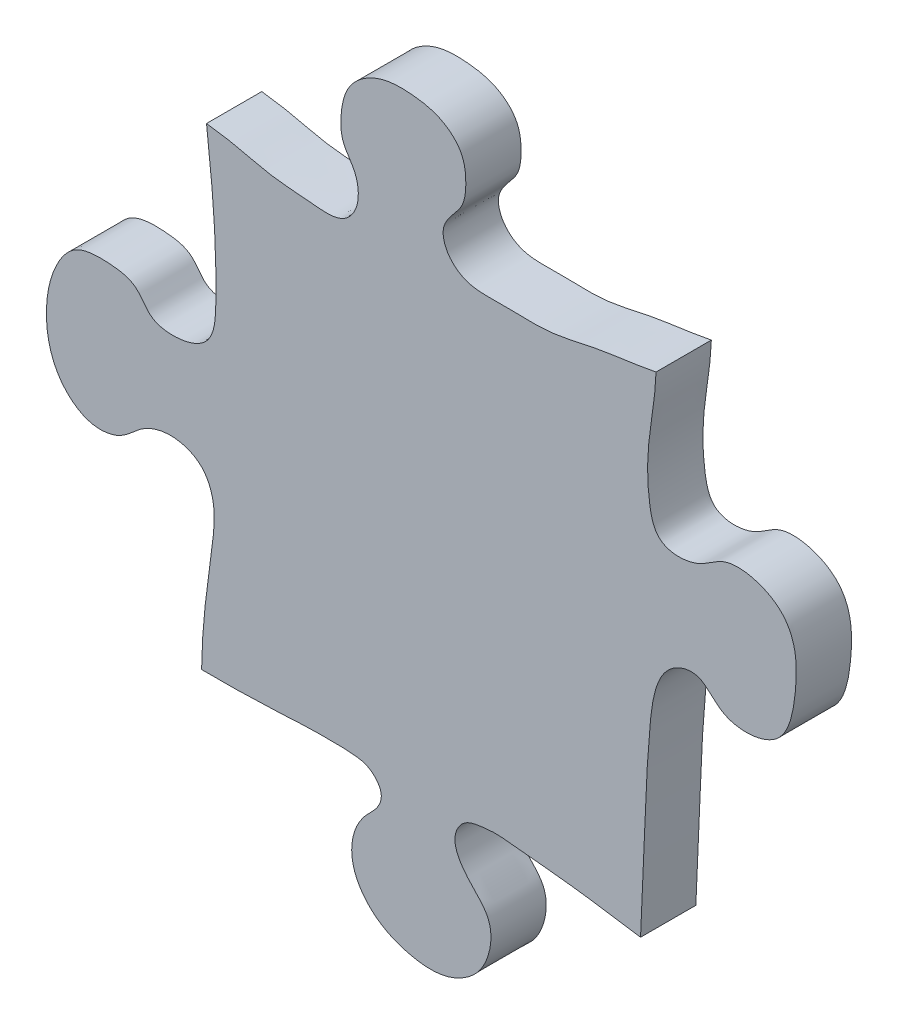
ISO-10303-21;
HEADER;
FILE_DESCRIPTION(('STEP AP214'),'2;1');
FILE_NAME('part.step','',(''),(''),'','','');
FILE_SCHEMA(('AUTOMOTIVE_DESIGN { 1 0 10303 214 1 1 1 1 }'));
ENDSEC;
DATA;
#1=APPLICATION_CONTEXT('core data for automotive mechanical design processes');
#2=APPLICATION_PROTOCOL_DEFINITION('international standard','automotive_design',2000,#1);
#3=PRODUCT_CONTEXT('',#1,'mechanical');
#4=PRODUCT('Part','Part','',(#3));
#5=PRODUCT_RELATED_PRODUCT_CATEGORY('part','',(#4));
#6=PRODUCT_DEFINITION_FORMATION('','',#4);
#7=PRODUCT_DEFINITION_CONTEXT('part definition',#1,'design');
#8=PRODUCT_DEFINITION('design','',#6,#7);
#9=PRODUCT_DEFINITION_SHAPE('','',#8);
#10=(LENGTH_UNIT() NAMED_UNIT(*) SI_UNIT(.MILLI.,.METRE.));
#11=(NAMED_UNIT(*) PLANE_ANGLE_UNIT() SI_UNIT($,.RADIAN.));
#12=(NAMED_UNIT(*) SI_UNIT($,.STERADIAN.) SOLID_ANGLE_UNIT());
#13=UNCERTAINTY_MEASURE_WITH_UNIT(LENGTH_MEASURE(1.E-05),#10,'distance_accuracy_value','');
#14=(GEOMETRIC_REPRESENTATION_CONTEXT(3) GLOBAL_UNCERTAINTY_ASSIGNED_CONTEXT((#13)) GLOBAL_UNIT_ASSIGNED_CONTEXT((#10,
#11,#12)) REPRESENTATION_CONTEXT('',''));
#15=CARTESIAN_POINT('',(0.,0.,0.));
#16=DIRECTION('',(0.,0.,1.));
#17=DIRECTION('',(1.,0.,0.));
#18=AXIS2_PLACEMENT_3D('',#15,#16,#17);
#19=CARTESIAN_POINT('',(-186.393246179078,356.,-0.00999999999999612));
#20=CARTESIAN_POINT('',(-186.465644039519,346.788250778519,-0.00999999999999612));
#21=CARTESIAN_POINT('',(-188.628884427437,329.478394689,-0.00999999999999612));
#22=CARTESIAN_POINT('',(-190.429976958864,304.816732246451,-0.00999999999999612));
#23=CARTESIAN_POINT('',(-187.884620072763,287.022607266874,-0.00999999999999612));
#24=CARTESIAN_POINT('',(-177.83183487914,273.701157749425,-0.00999999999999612));
#25=CARTESIAN_POINT('',(-167.372440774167,281.069990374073,-0.00999999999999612));
#26=CARTESIAN_POINT('',(-162.424812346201,293.671302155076,-0.00999999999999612));
#27=CARTESIAN_POINT('',(-138.980403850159,295.954762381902,-0.00999999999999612));
#28=CARTESIAN_POINT('',(-129.023505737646,274.502332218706,-0.00999999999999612));
#29=CARTESIAN_POINT('',(-130.151753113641,256.130310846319,-0.00999999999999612));
#30=CARTESIAN_POINT('',(-138.180313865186,240.882815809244,-0.00999999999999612));
#31=CARTESIAN_POINT('',(-153.903325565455,237.974697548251,-0.00999999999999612));
#32=CARTESIAN_POINT('',(-162.781582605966,247.270783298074,-0.00999999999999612));
#33=CARTESIAN_POINT('',(-171.61954140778,254.983724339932,-0.00999999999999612));
#34=CARTESIAN_POINT('',(-186.267660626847,251.663377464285,-0.00999999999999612));
#35=CARTESIAN_POINT('',(-188.178219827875,226.271427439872,-0.00999999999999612));
#36=CARTESIAN_POINT('',(-186.828985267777,214.10322906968,-0.00999999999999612));
#37=CARTESIAN_POINT('',(-182.631402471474,181.666904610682,-0.00999999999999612));
#38=CARTESIAN_POINT('',(-187.119801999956,157.75465666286,-0.00999999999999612));
#39=CARTESIAN_POINT('',(-187.457937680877,142.904539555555,-0.00999999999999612));
#40=CARTESIAN_POINT('',(-184.089404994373,126.204275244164,-0.00999999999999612));
#41=CARTESIAN_POINT('',(-168.499206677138,126.488047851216,-0.00999999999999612));
#42=CARTESIAN_POINT('',(-158.423592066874,136.759079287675,-0.00999999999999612));
#43=CARTESIAN_POINT('',(-133.598254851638,130.460350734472,-0.00999999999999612));
#44=CARTESIAN_POINT('',(-132.174041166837,109.25711139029,-0.00999999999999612));
#45=CARTESIAN_POINT('',(-137.401430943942,84.0677449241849,-0.00999999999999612));
#46=CARTESIAN_POINT('',(-159.905312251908,82.8448138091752,-0.00999999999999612));
#47=CARTESIAN_POINT('',(-167.594499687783,95.2630828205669,-0.00999999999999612));
#48=CARTESIAN_POINT('',(-184.064608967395,90.371493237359,-0.00999999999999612));
#49=CARTESIAN_POINT('',(-186.999172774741,63.1173196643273,-0.00999999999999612));
#50=CARTESIAN_POINT('',(-188.17555036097,34.3474510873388,-0.00999999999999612));
#51=CARTESIAN_POINT('',(-189.520016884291,-1.94344937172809,-0.00999999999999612));
#52=CARTESIAN_POINT('',(-192.230906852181,-38.9111914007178,-0.00999999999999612));
#53=CARTESIAN_POINT('',(-193.196462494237,-56.4819013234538,-0.00999999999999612));
#54=CARTESIAN_POINT('',(-187.787083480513,-81.0819408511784,-0.00999999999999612));
#55=CARTESIAN_POINT('',(-174.027975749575,-78.613025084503,-0.00999999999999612));
#56=CARTESIAN_POINT('',(-167.64120428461,-66.7586676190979,-0.00999999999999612));
#57=CARTESIAN_POINT('',(-138.878579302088,-69.8200733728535,-0.00999999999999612));
#58=CARTESIAN_POINT('',(-138.315063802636,-94.39593724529,-0.00999999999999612));
#59=CARTESIAN_POINT('',(-145.951566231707,-114.49908529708,-0.00999999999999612));
#60=CARTESIAN_POINT('',(-163.555921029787,-121.175747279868,-0.00999999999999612));
#61=CARTESIAN_POINT('',(-172.11578880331,-114.919909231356,-0.00999999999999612));
#62=CARTESIAN_POINT('',(-176.485425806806,-107.364168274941,-0.00999999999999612));
#63=CARTESIAN_POINT('',(-184.309097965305,-107.607264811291,-0.00999999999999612));
#64=CARTESIAN_POINT('',(-188.561946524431,-116.100575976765,-0.00999999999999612));
#65=CARTESIAN_POINT('',(-189.834439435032,-132.751458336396,-0.00999999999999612));
#66=CARTESIAN_POINT('',(-188.899668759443,-143.69775261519,-0.00999999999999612));
#67=CARTESIAN_POINT('',(-186.87437190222,-176.639875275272,-0.00999999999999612));
#68=CARTESIAN_POINT('',(-187.115886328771,-188.95785352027,-0.00999999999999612));
#69=CARTESIAN_POINT('',(-184.068917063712,-208.490912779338,-0.00999999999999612));
#70=CARTESIAN_POINT('',(-184.462371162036,-228.434350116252,-0.00999999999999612));
#71=CARTESIAN_POINT('',(-182.717405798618,-241.744671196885,-0.00999999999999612));
#72=CARTESIAN_POINT('',(-190.107123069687,-258.646375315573,-0.00999999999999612));
#73=CARTESIAN_POINT('',(-204.50360377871,-253.849993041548,-0.00999999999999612));
#74=CARTESIAN_POINT('',(-211.768269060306,-241.698033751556,-0.00999999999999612));
#75=CARTESIAN_POINT('',(-230.141572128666,-243.165284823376,-0.00999999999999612));
#76=CARTESIAN_POINT('',(-238.864067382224,-259.702852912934,-0.00999999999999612));
#77=CARTESIAN_POINT('',(-237.82033634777,-276.944530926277,-0.00999999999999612));
#78=CARTESIAN_POINT('',(-229.688332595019,-293.402921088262,-0.00999999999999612));
#79=CARTESIAN_POINT('',(-210.804716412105,-298.51720908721,-0.00999999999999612));
#80=CARTESIAN_POINT('',(-204.725260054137,-287.600226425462,-0.00999999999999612));
#81=CARTESIAN_POINT('',(-198.130842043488,-278.388409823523,-0.00999999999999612));
#82=CARTESIAN_POINT('',(-189.724281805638,-288.428094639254,-0.00999999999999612));
#83=CARTESIAN_POINT('',(-185.110914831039,-304.121783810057,-0.00999999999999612));
#84=CARTESIAN_POINT('',(-188.504639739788,-328.326605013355,-0.00999999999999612));
#85=CARTESIAN_POINT('',(-188.031330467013,-347.655914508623,-0.00999999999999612));
#86=CARTESIAN_POINT('',(-188.197680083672,-356.,-0.00999999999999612));
#87=B_SPLINE_CURVE_WITH_KNOTS('',3,(#19,#20,#21,#22,#23,#24,#25,#26,#27,#28,#29,#30,#31,#32,#33,
#34,#35,#36,#37,#38,#39,#40,#41,#42,#43,#44,#45,#46,#47,#48,#49,#50,#51,#52,#53,#54,#55,#56,#57,
#58,#59,#60,#61,#62,#63,#64,#65,#66,#67,#68,#69,#70,#71,#72,#73,#74,#75,#76,#77,#78,#79,#80,#81,
#82,#83,#84,#85,#86),.UNSPECIFIED.,.F.,.F.,(4,1,1,1,1,1,1,1,1,1,1,1,1,1,1,1,1,1,1,1,1,1,1,1,1,1,
1,1,1,1,1,1,1,1,1,1,1,1,1,1,1,1,1,1,1,1,1,1,1,1,1,1,1,1,1,1,1,1,1,1,1,1,1,1,1,4),(0.,
0.0262331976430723,0.050560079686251,0.0695219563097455,0.0800713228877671,0.0885051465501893,
0.099482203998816,0.118619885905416,0.138837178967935,0.157899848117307,0.171291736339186,
0.185151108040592,0.19559453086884,0.206745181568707,0.217337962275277,0.230877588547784,
0.26409725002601,0.28835141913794,0.305292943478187,0.32505690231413,0.334743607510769,
0.348191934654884,0.358741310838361,0.375812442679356,0.401272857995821,0.416827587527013,
0.432882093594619,0.444490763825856,0.458014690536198,0.481063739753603,0.510647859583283,
0.548186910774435,0.587648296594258,0.610908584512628,0.621783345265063,0.631931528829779,
0.643591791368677,0.658807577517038,0.686126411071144,0.703957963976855,0.718649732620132,
0.731300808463,0.735266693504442,0.736591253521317,0.743662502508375,0.746501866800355,
0.76410099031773,0.785041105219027,0.790214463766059,0.812987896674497,0.817887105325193,
0.836359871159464,0.84408330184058,0.853053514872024,0.86313504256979,0.875355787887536,
0.885829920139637,0.902341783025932,0.912788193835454,0.926625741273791,0.934943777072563,
0.940543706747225,0.946912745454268,0.957064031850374,0.980148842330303,1.),.UNSPECIFIED.);
#88=DIRECTION('',(0.,0.,1.));
#89=VECTOR('',#88,1.);
#90=SURFACE_OF_LINEAR_EXTRUSION('',#87,#89);
#91=CARTESIAN_POINT('',(-186.393246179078,356.,20.));
#92=CARTESIAN_POINT('',(-186.465644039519,346.788250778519,20.));
#93=CARTESIAN_POINT('',(-188.628884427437,329.478394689,20.));
#94=CARTESIAN_POINT('',(-190.429976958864,304.816732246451,20.));
#95=CARTESIAN_POINT('',(-187.884620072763,287.022607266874,20.));
#96=CARTESIAN_POINT('',(-177.83183487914,273.701157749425,20.));
#97=CARTESIAN_POINT('',(-167.372440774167,281.069990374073,20.));
#98=CARTESIAN_POINT('',(-162.424812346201,293.671302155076,20.));
#99=CARTESIAN_POINT('',(-138.980403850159,295.954762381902,20.));
#100=CARTESIAN_POINT('',(-129.023505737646,274.502332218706,20.));
#101=CARTESIAN_POINT('',(-130.151753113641,256.130310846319,20.));
#102=CARTESIAN_POINT('',(-138.180313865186,240.882815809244,20.));
#103=CARTESIAN_POINT('',(-153.903325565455,237.974697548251,20.));
#104=CARTESIAN_POINT('',(-162.781582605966,247.270783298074,20.));
#105=CARTESIAN_POINT('',(-171.61954140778,254.983724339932,20.));
#106=CARTESIAN_POINT('',(-186.267660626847,251.663377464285,20.));
#107=CARTESIAN_POINT('',(-188.178219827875,226.271427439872,20.));
#108=CARTESIAN_POINT('',(-186.828985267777,214.10322906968,20.));
#109=CARTESIAN_POINT('',(-182.631402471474,181.666904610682,20.));
#110=CARTESIAN_POINT('',(-187.119801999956,157.75465666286,20.));
#111=CARTESIAN_POINT('',(-187.457937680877,142.904539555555,20.));
#112=CARTESIAN_POINT('',(-184.089404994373,126.204275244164,20.));
#113=CARTESIAN_POINT('',(-168.499206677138,126.488047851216,20.));
#114=CARTESIAN_POINT('',(-158.423592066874,136.759079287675,20.));
#115=CARTESIAN_POINT('',(-133.598254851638,130.460350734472,20.));
#116=CARTESIAN_POINT('',(-132.174041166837,109.25711139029,20.));
#117=CARTESIAN_POINT('',(-137.401430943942,84.0677449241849,20.));
#118=CARTESIAN_POINT('',(-159.905312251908,82.8448138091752,20.));
#119=CARTESIAN_POINT('',(-167.594499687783,95.2630828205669,20.));
#120=CARTESIAN_POINT('',(-184.064608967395,90.371493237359,20.));
#121=CARTESIAN_POINT('',(-186.999172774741,63.1173196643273,20.));
#122=CARTESIAN_POINT('',(-188.17555036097,34.3474510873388,20.));
#123=CARTESIAN_POINT('',(-189.520016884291,-1.94344937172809,20.));
#124=CARTESIAN_POINT('',(-192.230906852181,-38.9111914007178,20.));
#125=CARTESIAN_POINT('',(-193.196462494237,-56.4819013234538,20.));
#126=CARTESIAN_POINT('',(-187.787083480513,-81.0819408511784,20.));
#127=CARTESIAN_POINT('',(-174.027975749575,-78.613025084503,20.));
#128=CARTESIAN_POINT('',(-167.64120428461,-66.7586676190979,20.));
#129=CARTESIAN_POINT('',(-138.878579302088,-69.8200733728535,20.));
#130=CARTESIAN_POINT('',(-138.315063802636,-94.39593724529,20.));
#131=CARTESIAN_POINT('',(-145.951566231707,-114.49908529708,20.));
#132=CARTESIAN_POINT('',(-163.555921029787,-121.175747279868,20.));
#133=CARTESIAN_POINT('',(-172.11578880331,-114.919909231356,20.));
#134=CARTESIAN_POINT('',(-176.485425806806,-107.364168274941,20.));
#135=CARTESIAN_POINT('',(-184.309097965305,-107.607264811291,20.));
#136=CARTESIAN_POINT('',(-188.561946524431,-116.100575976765,20.));
#137=CARTESIAN_POINT('',(-189.834439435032,-132.751458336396,20.));
#138=CARTESIAN_POINT('',(-188.899668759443,-143.69775261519,20.));
#139=CARTESIAN_POINT('',(-186.87437190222,-176.639875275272,20.));
#140=CARTESIAN_POINT('',(-187.115886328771,-188.95785352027,20.));
#141=CARTESIAN_POINT('',(-184.068917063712,-208.490912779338,20.));
#142=CARTESIAN_POINT('',(-184.462371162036,-228.434350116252,20.));
#143=CARTESIAN_POINT('',(-182.717405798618,-241.744671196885,20.));
#144=CARTESIAN_POINT('',(-190.107123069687,-258.646375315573,20.));
#145=CARTESIAN_POINT('',(-204.50360377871,-253.849993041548,20.));
#146=CARTESIAN_POINT('',(-211.768269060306,-241.698033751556,20.));
#147=CARTESIAN_POINT('',(-230.141572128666,-243.165284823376,20.));
#148=CARTESIAN_POINT('',(-238.864067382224,-259.702852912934,20.));
#149=CARTESIAN_POINT('',(-237.82033634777,-276.944530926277,20.));
#150=CARTESIAN_POINT('',(-229.688332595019,-293.402921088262,20.));
#151=CARTESIAN_POINT('',(-210.804716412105,-298.51720908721,20.));
#152=CARTESIAN_POINT('',(-204.725260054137,-287.600226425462,20.));
#153=CARTESIAN_POINT('',(-198.130842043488,-278.388409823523,20.));
#154=CARTESIAN_POINT('',(-189.724281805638,-288.428094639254,20.));
#155=CARTESIAN_POINT('',(-185.110914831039,-304.121783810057,20.));
#156=CARTESIAN_POINT('',(-188.504639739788,-328.326605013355,20.));
#157=CARTESIAN_POINT('',(-188.031330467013,-347.655914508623,20.));
#158=CARTESIAN_POINT('',(-188.197680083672,-356.,20.));
#159=B_SPLINE_CURVE_WITH_KNOTS('',3,(#91,#92,#93,#94,#95,#96,#97,#98,#99,#100,#101,#102,#103,
#104,#105,#106,#107,#108,#109,#110,#111,#112,#113,#114,#115,#116,#117,#118,#119,#120,#121,#122,
#123,#124,#125,#126,#127,#128,#129,#130,#131,#132,#133,#134,#135,#136,#137,#138,#139,#140,#141,
#142,#143,#144,#145,#146,#147,#148,#149,#150,#151,#152,#153,#154,#155,#156,#157,#158),
.UNSPECIFIED.,.F.,.F.,(4,1,1,1,1,1,1,1,1,1,1,1,1,1,1,1,1,1,1,1,1,1,1,1,1,1,1,1,1,1,1,1,1,1,1,1,
1,1,1,1,1,1,1,1,1,1,1,1,1,1,1,1,1,1,1,1,1,1,1,1,1,1,1,1,1,4),(0.,0.0262331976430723,
0.050560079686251,0.0695219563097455,0.0800713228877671,0.0885051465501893,0.099482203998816,
0.118619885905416,0.138837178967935,0.157899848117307,0.171291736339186,0.185151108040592,
0.19559453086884,0.206745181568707,0.217337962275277,0.230877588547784,0.26409725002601,
0.28835141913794,0.305292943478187,0.32505690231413,0.334743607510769,0.348191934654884,
0.358741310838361,0.375812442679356,0.401272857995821,0.416827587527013,0.432882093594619,
0.444490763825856,0.458014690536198,0.481063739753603,0.510647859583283,0.548186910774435,
0.587648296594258,0.610908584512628,0.621783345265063,0.631931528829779,0.643591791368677,
0.658807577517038,0.686126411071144,0.703957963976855,0.718649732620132,0.731300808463,
0.735266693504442,0.736591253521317,0.743662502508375,0.746501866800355,0.76410099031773,
0.785041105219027,0.790214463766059,0.812987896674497,0.817887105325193,0.836359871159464,
0.84408330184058,0.853053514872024,0.86313504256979,0.875355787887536,0.885829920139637,
0.902341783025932,0.912788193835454,0.926625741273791,0.934943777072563,0.940543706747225,
0.946912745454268,0.957064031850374,0.980148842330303,1.),.UNSPECIFIED.);
#160=CARTESIAN_POINT('',(-184.013210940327,180.695478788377,20.));
#161=VERTEX_POINT('',#160);
#162=CARTESIAN_POINT('',(-189.617340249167,0.816183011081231,20.));
#163=VERTEX_POINT('',#162);
#164=EDGE_CURVE('E89',#161,#163,#159,.T.);
#165=ORIENTED_EDGE('',*,*,#164,.T.);
#166=DIRECTION('',(0.,0.,1.));
#167=VECTOR('',#166,1.);
#168=CARTESIAN_POINT('',(-189.617340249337,0.816183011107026,-0.00999999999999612));
#169=LINE('',#168,#167);
#170=CARTESIAN_POINT('',(-189.617340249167,0.816183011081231,0.));
#171=VERTEX_POINT('',#170);
#172=EDGE_CURVE('E78',#163,#171,#169,.F.);
#173=ORIENTED_EDGE('',*,*,#172,.T.);
#174=CARTESIAN_POINT('',(-186.393246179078,356.,0.));
#175=CARTESIAN_POINT('',(-186.465644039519,346.788250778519,0.));
#176=CARTESIAN_POINT('',(-188.628884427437,329.478394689,0.));
#177=CARTESIAN_POINT('',(-190.429976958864,304.816732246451,0.));
#178=CARTESIAN_POINT('',(-187.884620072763,287.022607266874,0.));
#179=CARTESIAN_POINT('',(-177.83183487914,273.701157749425,0.));
#180=CARTESIAN_POINT('',(-167.372440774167,281.069990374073,0.));
#181=CARTESIAN_POINT('',(-162.424812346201,293.671302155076,0.));
#182=CARTESIAN_POINT('',(-138.980403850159,295.954762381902,0.));
#183=CARTESIAN_POINT('',(-129.023505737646,274.502332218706,0.));
#184=CARTESIAN_POINT('',(-130.151753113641,256.130310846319,0.));
#185=CARTESIAN_POINT('',(-138.180313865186,240.882815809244,0.));
#186=CARTESIAN_POINT('',(-153.903325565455,237.974697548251,0.));
#187=CARTESIAN_POINT('',(-162.781582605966,247.270783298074,0.));
#188=CARTESIAN_POINT('',(-171.61954140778,254.983724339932,0.));
#189=CARTESIAN_POINT('',(-186.267660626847,251.663377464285,0.));
#190=CARTESIAN_POINT('',(-188.178219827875,226.271427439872,0.));
#191=CARTESIAN_POINT('',(-186.828985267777,214.10322906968,0.));
#192=CARTESIAN_POINT('',(-182.631402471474,181.666904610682,0.));
#193=CARTESIAN_POINT('',(-187.119801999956,157.75465666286,0.));
#194=CARTESIAN_POINT('',(-187.457937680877,142.904539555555,0.));
#195=CARTESIAN_POINT('',(-184.089404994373,126.204275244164,0.));
#196=CARTESIAN_POINT('',(-168.499206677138,126.488047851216,0.));
#197=CARTESIAN_POINT('',(-158.423592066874,136.759079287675,0.));
#198=CARTESIAN_POINT('',(-133.598254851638,130.460350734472,0.));
#199=CARTESIAN_POINT('',(-132.174041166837,109.25711139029,0.));
#200=CARTESIAN_POINT('',(-137.401430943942,84.0677449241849,0.));
#201=CARTESIAN_POINT('',(-159.905312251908,82.8448138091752,0.));
#202=CARTESIAN_POINT('',(-167.594499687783,95.2630828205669,0.));
#203=CARTESIAN_POINT('',(-184.064608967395,90.371493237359,0.));
#204=CARTESIAN_POINT('',(-186.999172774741,63.1173196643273,0.));
#205=CARTESIAN_POINT('',(-188.17555036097,34.3474510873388,0.));
#206=CARTESIAN_POINT('',(-189.520016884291,-1.94344937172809,0.));
#207=CARTESIAN_POINT('',(-192.230906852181,-38.9111914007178,0.));
#208=CARTESIAN_POINT('',(-193.196462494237,-56.4819013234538,0.));
#209=CARTESIAN_POINT('',(-187.787083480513,-81.0819408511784,0.));
#210=CARTESIAN_POINT('',(-174.027975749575,-78.613025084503,0.));
#211=CARTESIAN_POINT('',(-167.64120428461,-66.7586676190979,0.));
#212=CARTESIAN_POINT('',(-138.878579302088,-69.8200733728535,0.));
#213=CARTESIAN_POINT('',(-138.315063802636,-94.39593724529,0.));
#214=CARTESIAN_POINT('',(-145.951566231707,-114.49908529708,0.));
#215=CARTESIAN_POINT('',(-163.555921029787,-121.175747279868,0.));
#216=CARTESIAN_POINT('',(-172.11578880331,-114.919909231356,0.));
#217=CARTESIAN_POINT('',(-176.485425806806,-107.364168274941,0.));
#218=CARTESIAN_POINT('',(-184.309097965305,-107.607264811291,0.));
#219=CARTESIAN_POINT('',(-188.561946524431,-116.100575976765,0.));
#220=CARTESIAN_POINT('',(-189.834439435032,-132.751458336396,0.));
#221=CARTESIAN_POINT('',(-188.899668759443,-143.69775261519,0.));
#222=CARTESIAN_POINT('',(-186.87437190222,-176.639875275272,0.));
#223=CARTESIAN_POINT('',(-187.115886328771,-188.95785352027,0.));
#224=CARTESIAN_POINT('',(-184.068917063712,-208.490912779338,0.));
#225=CARTESIAN_POINT('',(-184.462371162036,-228.434350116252,0.));
#226=CARTESIAN_POINT('',(-182.717405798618,-241.744671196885,0.));
#227=CARTESIAN_POINT('',(-190.107123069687,-258.646375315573,0.));
#228=CARTESIAN_POINT('',(-204.50360377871,-253.849993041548,0.));
#229=CARTESIAN_POINT('',(-211.768269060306,-241.698033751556,0.));
#230=CARTESIAN_POINT('',(-230.141572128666,-243.165284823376,0.));
#231=CARTESIAN_POINT('',(-238.864067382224,-259.702852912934,0.));
#232=CARTESIAN_POINT('',(-237.82033634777,-276.944530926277,0.));
#233=CARTESIAN_POINT('',(-229.688332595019,-293.402921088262,0.));
#234=CARTESIAN_POINT('',(-210.804716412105,-298.51720908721,0.));
#235=CARTESIAN_POINT('',(-204.725260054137,-287.600226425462,0.));
#236=CARTESIAN_POINT('',(-198.130842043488,-278.388409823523,0.));
#237=CARTESIAN_POINT('',(-189.724281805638,-288.428094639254,0.));
#238=CARTESIAN_POINT('',(-185.110914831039,-304.121783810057,0.));
#239=CARTESIAN_POINT('',(-188.504639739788,-328.326605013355,0.));
#240=CARTESIAN_POINT('',(-188.031330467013,-347.655914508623,0.));
#241=CARTESIAN_POINT('',(-188.197680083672,-356.,0.));
#242=B_SPLINE_CURVE_WITH_KNOTS('',3,(#174,#175,#176,#177,#178,#179,#180,#181,#182,#183,#184,
#185,#186,#187,#188,#189,#190,#191,#192,#193,#194,#195,#196,#197,#198,#199,#200,#201,#202,#203,
#204,#205,#206,#207,#208,#209,#210,#211,#212,#213,#214,#215,#216,#217,#218,#219,#220,#221,#222,
#223,#224,#225,#226,#227,#228,#229,#230,#231,#232,#233,#234,#235,#236,#237,#238,#239,#240,#241),
.UNSPECIFIED.,.F.,.F.,(4,1,1,1,1,1,1,1,1,1,1,1,1,1,1,1,1,1,1,1,1,1,1,1,1,1,1,1,1,1,1,1,1,1,1,1,
1,1,1,1,1,1,1,1,1,1,1,1,1,1,1,1,1,1,1,1,1,1,1,1,1,1,1,1,1,4),(0.,0.0262331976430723,
0.050560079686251,0.0695219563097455,0.0800713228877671,0.0885051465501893,0.099482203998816,
0.118619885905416,0.138837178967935,0.157899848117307,0.171291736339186,0.185151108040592,
0.19559453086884,0.206745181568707,0.217337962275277,0.230877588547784,0.26409725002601,
0.28835141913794,0.305292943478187,0.32505690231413,0.334743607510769,0.348191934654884,
0.358741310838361,0.375812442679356,0.401272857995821,0.416827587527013,0.432882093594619,
0.444490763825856,0.458014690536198,0.481063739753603,0.510647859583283,0.548186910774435,
0.587648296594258,0.610908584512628,0.621783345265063,0.631931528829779,0.643591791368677,
0.658807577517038,0.686126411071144,0.703957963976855,0.718649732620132,0.731300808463,
0.735266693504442,0.736591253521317,0.743662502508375,0.746501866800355,0.76410099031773,
0.785041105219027,0.790214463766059,0.812987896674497,0.817887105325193,0.836359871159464,
0.84408330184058,0.853053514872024,0.86313504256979,0.875355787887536,0.885829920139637,
0.902341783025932,0.912788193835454,0.926625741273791,0.934943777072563,0.940543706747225,
0.946912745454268,0.957064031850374,0.980148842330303,1.),.UNSPECIFIED.);
#243=CARTESIAN_POINT('',(-184.013210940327,180.695478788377,0.));
#244=VERTEX_POINT('',#243);
#245=EDGE_CURVE('E102',#244,#171,#242,.T.);
#246=ORIENTED_EDGE('',*,*,#245,.F.);
#247=DIRECTION('',(0.,0.,1.));
#248=VECTOR('',#247,1.);
#249=CARTESIAN_POINT('',(-184.013210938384,180.695478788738,-0.00999999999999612));
#250=LINE('',#249,#248);
#251=EDGE_CURVE('E85',#161,#244,#250,.F.);
#252=ORIENTED_EDGE('',*,*,#251,.F.);
#253=EDGE_LOOP('',(#165,#173,#246,#252));
#254=FACE_BOUND('',#253,.T.);
#255=ADVANCED_FACE('F34',(#254),#90,.F.);
#256=CARTESIAN_POINT('',(-352.534626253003,356.,-0.00999999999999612));
#257=CARTESIAN_POINT('',(-353.877781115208,341.802611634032,-0.00999999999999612));
#258=CARTESIAN_POINT('',(-351.460483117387,322.567956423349,-0.00999999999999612));
#259=CARTESIAN_POINT('',(-355.747404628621,299.493999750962,-0.00999999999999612));
#260=CARTESIAN_POINT('',(-347.645743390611,289.357079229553,-0.00999999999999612));
#261=CARTESIAN_POINT('',(-337.80105524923,293.322704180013,-0.00999999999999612));
#262=CARTESIAN_POINT('',(-331.763521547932,304.464683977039,-0.00999999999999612));
#263=CARTESIAN_POINT('',(-312.737993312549,300.417040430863,-0.00999999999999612));
#264=CARTESIAN_POINT('',(-304.311514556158,284.867329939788,-0.00999999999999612));
#265=CARTESIAN_POINT('',(-301.362858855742,267.518539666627,-0.00999999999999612));
#266=CARTESIAN_POINT('',(-309.525260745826,253.299800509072,-0.00999999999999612));
#267=CARTESIAN_POINT('',(-323.085028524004,249.130779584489,-0.00999999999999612));
#268=CARTESIAN_POINT('',(-333.558735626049,254.453066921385,-0.00999999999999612));
#269=CARTESIAN_POINT('',(-338.061007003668,263.306234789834,-0.00999999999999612));
#270=CARTESIAN_POINT('',(-357.610347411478,266.663664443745,-0.00999999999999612));
#271=CARTESIAN_POINT('',(-352.91397083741,227.568949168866,-0.00999999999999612));
#272=CARTESIAN_POINT('',(-349.689076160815,203.209436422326,-0.00999999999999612));
#273=CARTESIAN_POINT('',(-346.386977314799,175.800103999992,-0.00999999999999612));
#274=CARTESIAN_POINT('',(-343.691373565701,150.269708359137,-0.00999999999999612));
#275=CARTESIAN_POINT('',(-342.931567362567,128.594211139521,-0.00999999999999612));
#276=CARTESIAN_POINT('',(-343.655360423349,107.633085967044,-0.00999999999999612));
#277=CARTESIAN_POINT('',(-357.389603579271,103.824438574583,-0.00999999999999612));
#278=CARTESIAN_POINT('',(-367.576419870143,106.015828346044,-0.00999999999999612));
#279=CARTESIAN_POINT('',(-371.765750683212,114.589953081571,-0.00999999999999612));
#280=CARTESIAN_POINT('',(-382.535012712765,116.182843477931,-0.00999999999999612));
#281=CARTESIAN_POINT('',(-394.783984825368,115.916744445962,-0.00999999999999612));
#282=CARTESIAN_POINT('',(-402.322369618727,104.396558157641,-0.00999999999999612));
#283=CARTESIAN_POINT('',(-405.688784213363,89.1486295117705,-0.00999999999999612));
#284=CARTESIAN_POINT('',(-402.964002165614,71.2455616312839,-0.00999999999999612));
#285=CARTESIAN_POINT('',(-389.022909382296,60.8761001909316,-0.00999999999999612));
#286=CARTESIAN_POINT('',(-377.013010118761,63.0649709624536,-0.00999999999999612));
#287=CARTESIAN_POINT('',(-370.136212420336,70.9200889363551,-0.00999999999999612));
#288=CARTESIAN_POINT('',(-359.248489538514,74.3793713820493,-0.00999999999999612));
#289=CARTESIAN_POINT('',(-347.964757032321,70.4189230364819,-0.00999999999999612));
#290=CARTESIAN_POINT('',(-342.961480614,58.8762689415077,-0.00999999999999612));
#291=CARTESIAN_POINT('',(-344.957853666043,42.6141567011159,-0.00999999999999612));
#292=CARTESIAN_POINT('',(-348.090347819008,20.9428011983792,-0.00999999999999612));
#293=CARTESIAN_POINT('',(-348.787112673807,-1.92187291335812,-0.00999999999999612));
#294=CARTESIAN_POINT('',(-347.063507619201,-23.1354473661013,-0.00999999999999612));
#295=CARTESIAN_POINT('',(-345.803834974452,-40.1989543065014,-0.00999999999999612));
#296=CARTESIAN_POINT('',(-346.365109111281,-52.5147126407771,-0.00999999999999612));
#297=CARTESIAN_POINT('',(-346.987719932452,-61.0081322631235,-0.00999999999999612));
#298=CARTESIAN_POINT('',(-354.605588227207,-67.8105997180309,-0.00999999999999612));
#299=CARTESIAN_POINT('',(-368.483652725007,-69.9483525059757,-0.00999999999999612));
#300=CARTESIAN_POINT('',(-374.929468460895,-56.6181815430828,-0.00999999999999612));
#301=CARTESIAN_POINT('',(-389.51528778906,-54.9578642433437,-0.00999999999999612));
#302=CARTESIAN_POINT('',(-403.927113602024,-62.7741481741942,-0.00999999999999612));
#303=CARTESIAN_POINT('',(-408.906740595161,-79.6272624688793,-0.00999999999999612));
#304=CARTESIAN_POINT('',(-407.354009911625,-95.181625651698,-0.00999999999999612));
#305=CARTESIAN_POINT('',(-399.108136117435,-108.127376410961,-0.00999999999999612));
#306=CARTESIAN_POINT('',(-382.721304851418,-112.332091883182,-0.00999999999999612));
#307=CARTESIAN_POINT('',(-372.627066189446,-99.6029758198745,-0.00999999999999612));
#308=CARTESIAN_POINT('',(-359.245942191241,-98.6507630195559,-0.00999999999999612));
#309=CARTESIAN_POINT('',(-346.811479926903,-105.357996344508,-0.00999999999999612));
#310=CARTESIAN_POINT('',(-347.06309899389,-122.824759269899,-0.00999999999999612));
#311=CARTESIAN_POINT('',(-349.512128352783,-142.867981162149,-0.00999999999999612));
#312=CARTESIAN_POINT('',(-351.967561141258,-164.813498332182,-0.00999999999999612));
#313=CARTESIAN_POINT('',(-354.173348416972,-189.531702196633,-0.00999999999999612));
#314=CARTESIAN_POINT('',(-353.048503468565,-212.668893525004,-0.00999999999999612));
#315=CARTESIAN_POINT('',(-354.739062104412,-232.840407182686,-0.00999999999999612));
#316=CARTESIAN_POINT('',(-344.245211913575,-244.921596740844,-0.00999999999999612));
#317=CARTESIAN_POINT('',(-336.376475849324,-237.735778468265,-0.00999999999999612));
#318=CARTESIAN_POINT('',(-333.938993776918,-228.321764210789,-0.00999999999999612));
#319=CARTESIAN_POINT('',(-321.423877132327,-226.689197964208,-0.00999999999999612));
#320=CARTESIAN_POINT('',(-310.83224361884,-232.911014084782,-0.00999999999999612));
#321=CARTESIAN_POINT('',(-302.540379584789,-246.611975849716,-0.00999999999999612));
#322=CARTESIAN_POINT('',(-304.049270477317,-262.348985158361,-0.00999999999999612));
#323=CARTESIAN_POINT('',(-307.19247660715,-276.895908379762,-0.00999999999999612));
#324=CARTESIAN_POINT('',(-317.916754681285,-281.774853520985,-0.00999999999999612));
#325=CARTESIAN_POINT('',(-328.48323529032,-282.130896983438,-0.00999999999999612));
#326=CARTESIAN_POINT('',(-335.177873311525,-274.391757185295,-0.00999999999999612));
#327=CARTESIAN_POINT('',(-340.967044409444,-267.020526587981,-0.00999999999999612));
#328=CARTESIAN_POINT('',(-352.493784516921,-268.657509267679,-0.00999999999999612));
#329=CARTESIAN_POINT('',(-357.686319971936,-282.822093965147,-0.00999999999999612));
#330=CARTESIAN_POINT('',(-357.597756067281,-311.53856504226,-0.00999999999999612));
#331=CARTESIAN_POINT('',(-355.656952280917,-337.76537977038,-0.00999999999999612));
#332=CARTESIAN_POINT('',(-354.035135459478,-356.,-0.00999999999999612));
#333=B_SPLINE_CURVE_WITH_KNOTS('',3,(#256,#257,#258,#259,#260,#261,#262,#263,#264,#265,#266,
#267,#268,#269,#270,#271,#272,#273,#274,#275,#276,#277,#278,#279,#280,#281,#282,#283,#284,#285,
#286,#287,#288,#289,#290,#291,#292,#293,#294,#295,#296,#297,#298,#299,#300,#301,#302,#303,#304,
#305,#306,#307,#308,#309,#310,#311,#312,#313,#314,#315,#316,#317,#318,#319,#320,#321,#322,#323,
#324,#325,#326,#327,#328,#329,#330,#331,#332),.UNSPECIFIED.,.F.,.F.,(4,1,1,1,1,1,1,1,1,1,1,1,1,
1,1,1,1,1,1,1,1,1,1,1,1,1,1,1,1,1,1,1,1,1,1,1,1,1,1,1,1,1,1,1,1,1,1,1,1,1,1,1,1,1,1,1,1,1,1,1,1,
1,1,1,1,1,1,1,1,1,1,1,1,1,4),(0.,0.0362663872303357,0.0516957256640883,0.0575126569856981,
0.0656061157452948,0.0738542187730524,0.0886191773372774,0.103761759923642,0.118344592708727,
0.132658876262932,0.141706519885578,0.152628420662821,0.159936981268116,0.166346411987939,
0.196099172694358,0.222591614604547,0.242329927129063,0.265519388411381,0.28892287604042,
0.3014399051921,0.313339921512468,0.3200215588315,0.327007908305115,0.335496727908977,
0.346341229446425,0.356695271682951,0.367736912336,0.387395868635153,0.399447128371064,
0.408443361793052,0.416078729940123,0.425886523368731,0.4364139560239,0.44355209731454,
0.456701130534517,0.478081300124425,0.500737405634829,0.515722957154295,0.53328305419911,
0.545176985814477,0.547408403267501,0.555597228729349,0.568417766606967,0.576959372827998,
0.589646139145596,0.601337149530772,0.617107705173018,0.631663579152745,0.64088779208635,
0.655943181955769,0.666193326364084,0.679689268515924,0.687162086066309,0.700019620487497,
0.719317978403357,0.742088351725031,0.756487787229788,0.783860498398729,0.801622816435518,
0.8097052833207,0.815461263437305,0.824516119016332,0.833497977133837,0.842909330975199,
0.85562007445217,0.872330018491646,0.883598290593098,0.890881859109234,0.901363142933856,
0.908021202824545,0.916645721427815,0.924017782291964,0.933106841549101,0.95201687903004,1.),.UNSPECIFIED.);
#334=DIRECTION('',(0.,0.,1.));
#335=VECTOR('',#334,1.);
#336=SURFACE_OF_LINEAR_EXTRUSION('',#333,#335);
#337=CARTESIAN_POINT('',(-352.534626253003,356.,20.));
#338=CARTESIAN_POINT('',(-353.877781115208,341.802611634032,20.));
#339=CARTESIAN_POINT('',(-351.460483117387,322.567956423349,20.));
#340=CARTESIAN_POINT('',(-355.747404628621,299.493999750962,20.));
#341=CARTESIAN_POINT('',(-347.645743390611,289.357079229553,20.));
#342=CARTESIAN_POINT('',(-337.80105524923,293.322704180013,20.));
#343=CARTESIAN_POINT('',(-331.763521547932,304.464683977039,20.));
#344=CARTESIAN_POINT('',(-312.737993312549,300.417040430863,20.));
#345=CARTESIAN_POINT('',(-304.311514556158,284.867329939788,20.));
#346=CARTESIAN_POINT('',(-301.362858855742,267.518539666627,20.));
#347=CARTESIAN_POINT('',(-309.525260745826,253.299800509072,20.));
#348=CARTESIAN_POINT('',(-323.085028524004,249.130779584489,20.));
#349=CARTESIAN_POINT('',(-333.558735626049,254.453066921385,20.));
#350=CARTESIAN_POINT('',(-338.061007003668,263.306234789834,20.));
#351=CARTESIAN_POINT('',(-357.610347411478,266.663664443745,20.));
#352=CARTESIAN_POINT('',(-352.91397083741,227.568949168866,20.));
#353=CARTESIAN_POINT('',(-349.689076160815,203.209436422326,20.));
#354=CARTESIAN_POINT('',(-346.386977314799,175.800103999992,20.));
#355=CARTESIAN_POINT('',(-343.691373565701,150.269708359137,20.));
#356=CARTESIAN_POINT('',(-342.931567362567,128.594211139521,20.));
#357=CARTESIAN_POINT('',(-343.655360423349,107.633085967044,20.));
#358=CARTESIAN_POINT('',(-357.389603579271,103.824438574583,20.));
#359=CARTESIAN_POINT('',(-367.576419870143,106.015828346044,20.));
#360=CARTESIAN_POINT('',(-371.765750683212,114.589953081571,20.));
#361=CARTESIAN_POINT('',(-382.535012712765,116.182843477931,20.));
#362=CARTESIAN_POINT('',(-394.783984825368,115.916744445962,20.));
#363=CARTESIAN_POINT('',(-402.322369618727,104.396558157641,20.));
#364=CARTESIAN_POINT('',(-405.688784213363,89.1486295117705,20.));
#365=CARTESIAN_POINT('',(-402.964002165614,71.2455616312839,20.));
#366=CARTESIAN_POINT('',(-389.022909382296,60.8761001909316,20.));
#367=CARTESIAN_POINT('',(-377.013010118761,63.0649709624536,20.));
#368=CARTESIAN_POINT('',(-370.136212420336,70.9200889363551,20.));
#369=CARTESIAN_POINT('',(-359.248489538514,74.3793713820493,20.));
#370=CARTESIAN_POINT('',(-347.964757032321,70.4189230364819,20.));
#371=CARTESIAN_POINT('',(-342.961480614,58.8762689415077,20.));
#372=CARTESIAN_POINT('',(-344.957853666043,42.6141567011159,20.));
#373=CARTESIAN_POINT('',(-348.090347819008,20.9428011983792,20.));
#374=CARTESIAN_POINT('',(-348.787112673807,-1.92187291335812,20.));
#375=CARTESIAN_POINT('',(-347.063507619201,-23.1354473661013,20.));
#376=CARTESIAN_POINT('',(-345.803834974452,-40.1989543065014,20.));
#377=CARTESIAN_POINT('',(-346.365109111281,-52.5147126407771,20.));
#378=CARTESIAN_POINT('',(-346.987719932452,-61.0081322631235,20.));
#379=CARTESIAN_POINT('',(-354.605588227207,-67.8105997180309,20.));
#380=CARTESIAN_POINT('',(-368.483652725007,-69.9483525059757,20.));
#381=CARTESIAN_POINT('',(-374.929468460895,-56.6181815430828,20.));
#382=CARTESIAN_POINT('',(-389.51528778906,-54.9578642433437,20.));
#383=CARTESIAN_POINT('',(-403.927113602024,-62.7741481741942,20.));
#384=CARTESIAN_POINT('',(-408.906740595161,-79.6272624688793,20.));
#385=CARTESIAN_POINT('',(-407.354009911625,-95.181625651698,20.));
#386=CARTESIAN_POINT('',(-399.108136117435,-108.127376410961,20.));
#387=CARTESIAN_POINT('',(-382.721304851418,-112.332091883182,20.));
#388=CARTESIAN_POINT('',(-372.627066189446,-99.6029758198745,20.));
#389=CARTESIAN_POINT('',(-359.245942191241,-98.6507630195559,20.));
#390=CARTESIAN_POINT('',(-346.811479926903,-105.357996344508,20.));
#391=CARTESIAN_POINT('',(-347.06309899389,-122.824759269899,20.));
#392=CARTESIAN_POINT('',(-349.512128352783,-142.867981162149,20.));
#393=CARTESIAN_POINT('',(-351.967561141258,-164.813498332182,20.));
#394=CARTESIAN_POINT('',(-354.173348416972,-189.531702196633,20.));
#395=CARTESIAN_POINT('',(-353.048503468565,-212.668893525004,20.));
#396=CARTESIAN_POINT('',(-354.739062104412,-232.840407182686,20.));
#397=CARTESIAN_POINT('',(-344.245211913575,-244.921596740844,20.));
#398=CARTESIAN_POINT('',(-336.376475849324,-237.735778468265,20.));
#399=CARTESIAN_POINT('',(-333.938993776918,-228.321764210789,20.));
#400=CARTESIAN_POINT('',(-321.423877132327,-226.689197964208,20.));
#401=CARTESIAN_POINT('',(-310.83224361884,-232.911014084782,20.));
#402=CARTESIAN_POINT('',(-302.540379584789,-246.611975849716,20.));
#403=CARTESIAN_POINT('',(-304.049270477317,-262.348985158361,20.));
#404=CARTESIAN_POINT('',(-307.19247660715,-276.895908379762,20.));
#405=CARTESIAN_POINT('',(-317.916754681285,-281.774853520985,20.));
#406=CARTESIAN_POINT('',(-328.48323529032,-282.130896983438,20.));
#407=CARTESIAN_POINT('',(-335.177873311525,-274.391757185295,20.));
#408=CARTESIAN_POINT('',(-340.967044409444,-267.020526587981,20.));
#409=CARTESIAN_POINT('',(-352.493784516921,-268.657509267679,20.));
#410=CARTESIAN_POINT('',(-357.686319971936,-282.822093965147,20.));
#411=CARTESIAN_POINT('',(-357.597756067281,-311.53856504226,20.));
#412=CARTESIAN_POINT('',(-355.656952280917,-337.76537977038,20.));
#413=CARTESIAN_POINT('',(-354.035135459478,-356.,20.));
#414=B_SPLINE_CURVE_WITH_KNOTS('',3,(#337,#338,#339,#340,#341,#342,#343,#344,#345,#346,#347,
#348,#349,#350,#351,#352,#353,#354,#355,#356,#357,#358,#359,#360,#361,#362,#363,#364,#365,#366,
#367,#368,#369,#370,#371,#372,#373,#374,#375,#376,#377,#378,#379,#380,#381,#382,#383,#384,#385,
#386,#387,#388,#389,#390,#391,#392,#393,#394,#395,#396,#397,#398,#399,#400,#401,#402,#403,#404,
#405,#406,#407,#408,#409,#410,#411,#412,#413),.UNSPECIFIED.,.F.,.F.,(4,1,1,1,1,1,1,1,1,1,1,1,1,
1,1,1,1,1,1,1,1,1,1,1,1,1,1,1,1,1,1,1,1,1,1,1,1,1,1,1,1,1,1,1,1,1,1,1,1,1,1,1,1,1,1,1,1,1,1,1,1,
1,1,1,1,1,1,1,1,1,1,1,1,1,4),(0.,0.0362663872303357,0.0516957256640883,0.0575126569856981,
0.0656061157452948,0.0738542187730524,0.0886191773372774,0.103761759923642,0.118344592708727,
0.132658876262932,0.141706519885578,0.152628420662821,0.159936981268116,0.166346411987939,
0.196099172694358,0.222591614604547,0.242329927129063,0.265519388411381,0.28892287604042,
0.3014399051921,0.313339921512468,0.3200215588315,0.327007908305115,0.335496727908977,
0.346341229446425,0.356695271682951,0.367736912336,0.387395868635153,0.399447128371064,
0.408443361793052,0.416078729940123,0.425886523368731,0.4364139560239,0.44355209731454,
0.456701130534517,0.478081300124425,0.500737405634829,0.515722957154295,0.53328305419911,
0.545176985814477,0.547408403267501,0.555597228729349,0.568417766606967,0.576959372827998,
0.589646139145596,0.601337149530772,0.617107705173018,0.631663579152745,0.64088779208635,
0.655943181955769,0.666193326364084,0.679689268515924,0.687162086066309,0.700019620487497,
0.719317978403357,0.742088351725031,0.756487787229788,0.783860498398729,0.801622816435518,
0.8097052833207,0.815461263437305,0.824516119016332,0.833497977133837,0.842909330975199,
0.85562007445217,0.872330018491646,0.883598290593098,0.890881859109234,0.901363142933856,
0.908021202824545,0.916645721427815,0.924017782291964,0.933106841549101,0.95201687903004,1.),.UNSPECIFIED.);
#415=CARTESIAN_POINT('',(-346.614016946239,177.25293926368,20.));
#416=VERTEX_POINT('',#415);
#417=CARTESIAN_POINT('',(-348.40314200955,5.28695656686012,20.));
#418=VERTEX_POINT('',#417);
#419=EDGE_CURVE('E94',#416,#418,#414,.T.);
#420=ORIENTED_EDGE('',*,*,#419,.F.);
#421=DIRECTION('',(0.,0.,1.));
#422=VECTOR('',#421,1.);
#423=CARTESIAN_POINT('',(-346.614016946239,177.25293926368,-0.00999999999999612));
#424=LINE('',#423,#422);
#425=CARTESIAN_POINT('',(-346.614016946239,177.25293926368,0.));
#426=VERTEX_POINT('',#425);
#427=EDGE_CURVE('E11',#426,#416,#424,.T.);
#428=ORIENTED_EDGE('',*,*,#427,.F.);
#429=CARTESIAN_POINT('',(-352.534626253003,356.,0.));
#430=CARTESIAN_POINT('',(-353.877781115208,341.802611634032,0.));
#431=CARTESIAN_POINT('',(-351.460483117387,322.567956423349,0.));
#432=CARTESIAN_POINT('',(-355.747404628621,299.493999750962,0.));
#433=CARTESIAN_POINT('',(-347.645743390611,289.357079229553,0.));
#434=CARTESIAN_POINT('',(-337.80105524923,293.322704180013,0.));
#435=CARTESIAN_POINT('',(-331.763521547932,304.464683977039,0.));
#436=CARTESIAN_POINT('',(-312.737993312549,300.417040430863,0.));
#437=CARTESIAN_POINT('',(-304.311514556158,284.867329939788,0.));
#438=CARTESIAN_POINT('',(-301.362858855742,267.518539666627,0.));
#439=CARTESIAN_POINT('',(-309.525260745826,253.299800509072,0.));
#440=CARTESIAN_POINT('',(-323.085028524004,249.130779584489,0.));
#441=CARTESIAN_POINT('',(-333.558735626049,254.453066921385,0.));
#442=CARTESIAN_POINT('',(-338.061007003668,263.306234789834,0.));
#443=CARTESIAN_POINT('',(-357.610347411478,266.663664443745,0.));
#444=CARTESIAN_POINT('',(-352.91397083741,227.568949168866,0.));
#445=CARTESIAN_POINT('',(-349.689076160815,203.209436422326,0.));
#446=CARTESIAN_POINT('',(-346.386977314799,175.800103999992,0.));
#447=CARTESIAN_POINT('',(-343.691373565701,150.269708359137,0.));
#448=CARTESIAN_POINT('',(-342.931567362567,128.594211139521,0.));
#449=CARTESIAN_POINT('',(-343.655360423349,107.633085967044,0.));
#450=CARTESIAN_POINT('',(-357.389603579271,103.824438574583,0.));
#451=CARTESIAN_POINT('',(-367.576419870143,106.015828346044,0.));
#452=CARTESIAN_POINT('',(-371.765750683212,114.589953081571,0.));
#453=CARTESIAN_POINT('',(-382.535012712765,116.182843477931,0.));
#454=CARTESIAN_POINT('',(-394.783984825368,115.916744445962,0.));
#455=CARTESIAN_POINT('',(-402.322369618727,104.396558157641,0.));
#456=CARTESIAN_POINT('',(-405.688784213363,89.1486295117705,0.));
#457=CARTESIAN_POINT('',(-402.964002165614,71.2455616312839,0.));
#458=CARTESIAN_POINT('',(-389.022909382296,60.8761001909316,0.));
#459=CARTESIAN_POINT('',(-377.013010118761,63.0649709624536,0.));
#460=CARTESIAN_POINT('',(-370.136212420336,70.9200889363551,0.));
#461=CARTESIAN_POINT('',(-359.248489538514,74.3793713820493,0.));
#462=CARTESIAN_POINT('',(-347.964757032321,70.4189230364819,0.));
#463=CARTESIAN_POINT('',(-342.961480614,58.8762689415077,0.));
#464=CARTESIAN_POINT('',(-344.957853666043,42.6141567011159,0.));
#465=CARTESIAN_POINT('',(-348.090347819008,20.9428011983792,0.));
#466=CARTESIAN_POINT('',(-348.787112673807,-1.92187291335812,0.));
#467=CARTESIAN_POINT('',(-347.063507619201,-23.1354473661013,0.));
#468=CARTESIAN_POINT('',(-345.803834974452,-40.1989543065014,0.));
#469=CARTESIAN_POINT('',(-346.365109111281,-52.5147126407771,0.));
#470=CARTESIAN_POINT('',(-346.987719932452,-61.0081322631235,0.));
#471=CARTESIAN_POINT('',(-354.605588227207,-67.8105997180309,0.));
#472=CARTESIAN_POINT('',(-368.483652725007,-69.9483525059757,0.));
#473=CARTESIAN_POINT('',(-374.929468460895,-56.6181815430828,0.));
#474=CARTESIAN_POINT('',(-389.51528778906,-54.9578642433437,0.));
#475=CARTESIAN_POINT('',(-403.927113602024,-62.7741481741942,0.));
#476=CARTESIAN_POINT('',(-408.906740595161,-79.6272624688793,0.));
#477=CARTESIAN_POINT('',(-407.354009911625,-95.181625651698,0.));
#478=CARTESIAN_POINT('',(-399.108136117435,-108.127376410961,0.));
#479=CARTESIAN_POINT('',(-382.721304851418,-112.332091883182,0.));
#480=CARTESIAN_POINT('',(-372.627066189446,-99.6029758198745,0.));
#481=CARTESIAN_POINT('',(-359.245942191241,-98.6507630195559,0.));
#482=CARTESIAN_POINT('',(-346.811479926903,-105.357996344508,0.));
#483=CARTESIAN_POINT('',(-347.06309899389,-122.824759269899,0.));
#484=CARTESIAN_POINT('',(-349.512128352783,-142.867981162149,0.));
#485=CARTESIAN_POINT('',(-351.967561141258,-164.813498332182,0.));
#486=CARTESIAN_POINT('',(-354.173348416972,-189.531702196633,0.));
#487=CARTESIAN_POINT('',(-353.048503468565,-212.668893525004,0.));
#488=CARTESIAN_POINT('',(-354.739062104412,-232.840407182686,0.));
#489=CARTESIAN_POINT('',(-344.245211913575,-244.921596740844,0.));
#490=CARTESIAN_POINT('',(-336.376475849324,-237.735778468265,0.));
#491=CARTESIAN_POINT('',(-333.938993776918,-228.321764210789,0.));
#492=CARTESIAN_POINT('',(-321.423877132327,-226.689197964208,0.));
#493=CARTESIAN_POINT('',(-310.83224361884,-232.911014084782,0.));
#494=CARTESIAN_POINT('',(-302.540379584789,-246.611975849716,0.));
#495=CARTESIAN_POINT('',(-304.049270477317,-262.348985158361,0.));
#496=CARTESIAN_POINT('',(-307.19247660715,-276.895908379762,0.));
#497=CARTESIAN_POINT('',(-317.916754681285,-281.774853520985,0.));
#498=CARTESIAN_POINT('',(-328.48323529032,-282.130896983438,0.));
#499=CARTESIAN_POINT('',(-335.177873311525,-274.391757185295,0.));
#500=CARTESIAN_POINT('',(-340.967044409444,-267.020526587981,0.));
#501=CARTESIAN_POINT('',(-352.493784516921,-268.657509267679,0.));
#502=CARTESIAN_POINT('',(-357.686319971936,-282.822093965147,0.));
#503=CARTESIAN_POINT('',(-357.597756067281,-311.53856504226,0.));
#504=CARTESIAN_POINT('',(-355.656952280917,-337.76537977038,0.));
#505=CARTESIAN_POINT('',(-354.035135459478,-356.,0.));
#506=B_SPLINE_CURVE_WITH_KNOTS('',3,(#429,#430,#431,#432,#433,#434,#435,#436,#437,#438,#439,
#440,#441,#442,#443,#444,#445,#446,#447,#448,#449,#450,#451,#452,#453,#454,#455,#456,#457,#458,
#459,#460,#461,#462,#463,#464,#465,#466,#467,#468,#469,#470,#471,#472,#473,#474,#475,#476,#477,
#478,#479,#480,#481,#482,#483,#484,#485,#486,#487,#488,#489,#490,#491,#492,#493,#494,#495,#496,
#497,#498,#499,#500,#501,#502,#503,#504,#505),.UNSPECIFIED.,.F.,.F.,(4,1,1,1,1,1,1,1,1,1,1,1,1,
1,1,1,1,1,1,1,1,1,1,1,1,1,1,1,1,1,1,1,1,1,1,1,1,1,1,1,1,1,1,1,1,1,1,1,1,1,1,1,1,1,1,1,1,1,1,1,1,
1,1,1,1,1,1,1,1,1,1,1,1,1,4),(0.,0.0362663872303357,0.0516957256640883,0.0575126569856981,
0.0656061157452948,0.0738542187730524,0.0886191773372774,0.103761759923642,0.118344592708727,
0.132658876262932,0.141706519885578,0.152628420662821,0.159936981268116,0.166346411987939,
0.196099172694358,0.222591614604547,0.242329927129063,0.265519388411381,0.28892287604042,
0.3014399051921,0.313339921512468,0.3200215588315,0.327007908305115,0.335496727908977,
0.346341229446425,0.356695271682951,0.367736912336,0.387395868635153,0.399447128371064,
0.408443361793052,0.416078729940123,0.425886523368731,0.4364139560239,0.44355209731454,
0.456701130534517,0.478081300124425,0.500737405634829,0.515722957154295,0.53328305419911,
0.545176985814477,0.547408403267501,0.555597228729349,0.568417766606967,0.576959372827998,
0.589646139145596,0.601337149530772,0.617107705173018,0.631663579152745,0.64088779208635,
0.655943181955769,0.666193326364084,0.679689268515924,0.687162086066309,0.700019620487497,
0.719317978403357,0.742088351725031,0.756487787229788,0.783860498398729,0.801622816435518,
0.8097052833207,0.815461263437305,0.824516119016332,0.833497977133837,0.842909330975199,
0.85562007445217,0.872330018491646,0.883598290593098,0.890881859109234,0.901363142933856,
0.908021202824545,0.916645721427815,0.924017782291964,0.933106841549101,0.95201687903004,1.),.UNSPECIFIED.);
#507=CARTESIAN_POINT('',(-348.40314200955,5.28695656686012,0.));
#508=VERTEX_POINT('',#507);
#509=EDGE_CURVE('E86',#426,#508,#506,.T.);
#510=ORIENTED_EDGE('',*,*,#509,.T.);
#511=DIRECTION('',(0.,0.,1.));
#512=VECTOR('',#511,1.);
#513=CARTESIAN_POINT('',(-348.403142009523,5.28695656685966,-0.00999999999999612));
#514=LINE('',#513,#512);
#515=EDGE_CURVE('E119',#418,#508,#514,.F.);
#516=ORIENTED_EDGE('',*,*,#515,.F.);
#517=EDGE_LOOP('',(#420,#428,#510,#516));
#518=FACE_BOUND('',#517,.T.);
#519=ADVANCED_FACE('F141',(#518),#336,.T.);
#520=CARTESIAN_POINT('',(-349.139880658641,5.30046994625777,-0.00999999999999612));
#521=CARTESIAN_POINT('',(-339.887860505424,5.11479546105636,-0.00999999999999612));
#522=CARTESIAN_POINT('',(-319.891606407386,5.70075392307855,-0.00999999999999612));
#523=CARTESIAN_POINT('',(-312.057252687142,6.39377361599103,-0.00999999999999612));
#524=CARTESIAN_POINT('',(-295.557040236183,6.5821024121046,-0.00999999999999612));
#525=CARTESIAN_POINT('',(-287.520649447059,5.38238329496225,-0.00999999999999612));
#526=CARTESIAN_POINT('',(-282.231232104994,-0.739375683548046,-0.00999999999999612));
#527=CARTESIAN_POINT('',(-284.631758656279,-6.70157001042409,-0.00999999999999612));
#528=CARTESIAN_POINT('',(-290.291633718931,-11.4270553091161,-0.00999999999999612));
#529=CARTESIAN_POINT('',(-294.264404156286,-19.1154923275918,-0.00999999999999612));
#530=CARTESIAN_POINT('',(-294.324045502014,-31.0075730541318,-0.00999999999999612));
#531=CARTESIAN_POINT('',(-285.696757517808,-42.2618535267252,-0.00999999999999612));
#532=CARTESIAN_POINT('',(-271.389959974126,-47.4058055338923,-0.00999999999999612));
#533=CARTESIAN_POINT('',(-259.358947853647,-47.5927514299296,-0.00999999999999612));
#534=CARTESIAN_POINT('',(-248.949507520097,-41.269541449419,-0.00999999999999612));
#535=CARTESIAN_POINT('',(-243.879910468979,-32.2576865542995,-0.00999999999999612));
#536=CARTESIAN_POINT('',(-242.928014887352,-21.7896256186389,-0.00999999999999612));
#537=CARTESIAN_POINT('',(-249.227477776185,-14.851631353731,-0.00999999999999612));
#538=CARTESIAN_POINT('',(-254.593465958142,-9.43942563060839,-0.00999999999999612));
#539=CARTESIAN_POINT('',(-258.137345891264,-1.50662300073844,-0.00999999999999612));
#540=CARTESIAN_POINT('',(-253.898534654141,5.55474508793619,-0.00999999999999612));
#541=CARTESIAN_POINT('',(-243.567188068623,7.43755302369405,-0.00999999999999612));
#542=CARTESIAN_POINT('',(-237.879490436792,6.8669695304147,-0.00999999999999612));
#543=CARTESIAN_POINT('',(-212.535663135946,4.31355413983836,-0.00999999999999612));
#544=CARTESIAN_POINT('',(-204.857637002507,3.06770049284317,-0.00999999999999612));
#545=CARTESIAN_POINT('',(-187.870824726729,0.576823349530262,-0.00999999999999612));
#546=CARTESIAN_POINT('',(-180.873341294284,-0.585089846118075,-0.00999999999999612));
#547=CARTESIAN_POINT('',(-167.321297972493,-4.05861827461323,-0.00999999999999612));
#548=CARTESIAN_POINT('',(-158.264072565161,-5.81322262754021,-0.00999999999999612));
#549=CARTESIAN_POINT('',(-139.329328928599,-8.34288673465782,-0.00999999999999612));
#550=CARTESIAN_POINT('',(-132.040798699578,-2.9845391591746,-0.00999999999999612));
#551=CARTESIAN_POINT('',(-129.761885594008,4.23046807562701,-0.00999999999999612));
#552=CARTESIAN_POINT('',(-131.710784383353,10.4013258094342,-0.00999999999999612));
#553=CARTESIAN_POINT('',(-133.710968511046,14.6601816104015,-0.00999999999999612));
#554=CARTESIAN_POINT('',(-138.026269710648,21.724753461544,-0.00999999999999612));
#555=CARTESIAN_POINT('',(-138.081917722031,32.3728530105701,-0.00999999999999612));
#556=CARTESIAN_POINT('',(-131.83570692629,43.0815337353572,-0.00999999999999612));
#557=CARTESIAN_POINT('',(-119.794248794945,47.304204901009,-0.00999999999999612));
#558=CARTESIAN_POINT('',(-108.957899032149,47.5382470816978,-0.00999999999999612));
#559=CARTESIAN_POINT('',(-96.8719484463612,45.7015776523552,-0.00999999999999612));
#560=CARTESIAN_POINT('',(-87.0853124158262,37.0457421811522,-0.00999999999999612));
#561=CARTESIAN_POINT('',(-87.3806461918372,25.6113797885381,-0.00999999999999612));
#562=CARTESIAN_POINT('',(-91.1138584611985,18.4470720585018,-0.00999999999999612));
#563=CARTESIAN_POINT('',(-96.1690771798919,13.9582424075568,-0.00999999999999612));
#564=CARTESIAN_POINT('',(-97.7539111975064,6.63580226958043,-0.00999999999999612));
#565=CARTESIAN_POINT('',(-93.1531213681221,0.225805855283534,-0.00999999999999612));
#566=CARTESIAN_POINT('',(-85.7868945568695,-4.22125029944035,-0.00999999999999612));
#567=CARTESIAN_POINT('',(-75.4922823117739,-4.72742713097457,-0.00999999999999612));
#568=CARTESIAN_POINT('',(-63.6021774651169,-3.739894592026,-0.00999999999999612));
#569=CARTESIAN_POINT('',(-47.1576847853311,-2.15281130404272,-0.00999999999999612));
#570=CARTESIAN_POINT('',(-35.4735305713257,-1.02782701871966,-0.00999999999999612));
#571=CARTESIAN_POINT('',(-9.55974097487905,5.44923466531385,-0.00999999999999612));
#572=CARTESIAN_POINT('',(5.33335319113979,5.64341864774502,-0.00999999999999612));
#573=CARTESIAN_POINT('',(26.8877087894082,6.61154693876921,-0.00999999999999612));
#574=CARTESIAN_POINT('',(40.3616385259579,6.66752296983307,-0.00999999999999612));
#575=CARTESIAN_POINT('',(55.4069140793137,6.55682515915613,-0.00999999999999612));
#576=CARTESIAN_POINT('',(60.9823316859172,-1.76204700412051,-0.00999999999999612));
#577=CARTESIAN_POINT('',(62.7286219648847,-10.7101888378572,-0.00999999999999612));
#578=CARTESIAN_POINT('',(58.0719160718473,-18.2162229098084,-0.00999999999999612));
#579=CARTESIAN_POINT('',(50.4934538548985,-22.6369036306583,-0.00999999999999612));
#580=CARTESIAN_POINT('',(49.5191525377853,-32.4601424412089,-0.00999999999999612));
#581=CARTESIAN_POINT('',(50.9102608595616,-43.3041677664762,-0.00999999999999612));
#582=CARTESIAN_POINT('',(60.9494806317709,-51.7611152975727,-0.00999999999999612));
#583=CARTESIAN_POINT('',(73.8438777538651,-54.9427485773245,-0.00999999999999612));
#584=CARTESIAN_POINT('',(86.4324503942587,-54.0451489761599,-0.00999999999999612));
#585=CARTESIAN_POINT('',(96.2763408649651,-49.8211627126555,-0.00999999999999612));
#586=CARTESIAN_POINT('',(101.788676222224,-42.6926438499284,-0.00999999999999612));
#587=CARTESIAN_POINT('',(103.785622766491,-33.9307441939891,-0.00999999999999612));
#588=CARTESIAN_POINT('',(101.793989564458,-26.0744158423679,-0.00999999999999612));
#589=CARTESIAN_POINT('',(95.2302198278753,-18.82812621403,-0.00999999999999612));
#590=CARTESIAN_POINT('',(89.6165079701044,-10.8535457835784,-0.00999999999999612));
#591=CARTESIAN_POINT('',(88.5833289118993,0.119561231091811,-0.00999999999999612));
#592=CARTESIAN_POINT('',(98.1406475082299,6.80161389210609,-0.00999999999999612));
#593=CARTESIAN_POINT('',(110.075702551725,4.83412068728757,-0.00999999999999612));
#594=CARTESIAN_POINT('',(121.713926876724,4.79342247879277,-0.00999999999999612));
#595=CARTESIAN_POINT('',(136.161134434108,3.20442078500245,-0.00999999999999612));
#596=CARTESIAN_POINT('',(149.301551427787,2.24618232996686,-0.00999999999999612));
#597=CARTESIAN_POINT('',(163.635697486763,1.11607382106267,-0.00999999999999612));
#598=CARTESIAN_POINT('',(175.743984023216,-0.930199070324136,-0.00999999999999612));
#599=CARTESIAN_POINT('',(193.50042565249,-4.03526402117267,-0.00999999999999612));
#600=CARTESIAN_POINT('',(199.307125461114,-4.82007249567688,-0.00999999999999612));
#601=CARTESIAN_POINT('',(223.191668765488,-7.20796265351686,-0.00999999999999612));
#602=CARTESIAN_POINT('',(234.005762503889,-7.89583073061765,-0.00999999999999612));
#603=CARTESIAN_POINT('',(243.165304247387,-4.21144732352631,-0.00999999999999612));
#604=CARTESIAN_POINT('',(242.728227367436,5.29385628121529,-0.00999999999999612));
#605=CARTESIAN_POINT('',(239.691190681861,13.3923508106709,-0.00999999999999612));
#606=CARTESIAN_POINT('',(230.992924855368,17.259551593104,-0.00999999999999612));
#607=CARTESIAN_POINT('',(228.562234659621,35.6530691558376,-0.00999999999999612));
#608=CARTESIAN_POINT('',(241.485133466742,51.1639498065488,-0.00999999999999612));
#609=CARTESIAN_POINT('',(261.294428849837,50.4989765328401,-0.00999999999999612));
#610=CARTESIAN_POINT('',(273.311157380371,41.2796485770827,-0.00999999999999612));
#611=CARTESIAN_POINT('',(278.244185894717,29.7939334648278,-0.00999999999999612));
#612=CARTESIAN_POINT('',(278.46311043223,19.1716807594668,-0.00999999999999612));
#613=CARTESIAN_POINT('',(273.41239647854,11.7823053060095,-0.00999999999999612));
#614=CARTESIAN_POINT('',(269.462797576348,8.07180362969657,-0.00999999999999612));
#615=CARTESIAN_POINT('',(268.275297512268,1.27447756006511,-0.00999999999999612));
#616=CARTESIAN_POINT('',(269.56536006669,-2.1294813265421,-0.00999999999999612));
#617=CARTESIAN_POINT('',(273.239630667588,-8.77034024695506,-0.00999999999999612));
#618=CARTESIAN_POINT('',(289.550418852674,-6.96961632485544,-0.00999999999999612));
#619=CARTESIAN_POINT('',(304.280714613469,-6.71047567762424,-0.00999999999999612));
#620=CARTESIAN_POINT('',(324.326281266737,-6.23084088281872,-0.00999999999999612));
#621=CARTESIAN_POINT('',(349.235083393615,-7.00547217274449,-0.00999999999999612));
#622=CARTESIAN_POINT('',(375.517421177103,-8.89168640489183,-0.00999999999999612));
#623=CARTESIAN_POINT('',(398.91687007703,-8.79198570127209,-0.00999999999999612));
#624=CARTESIAN_POINT('',(415.173568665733,-7.26147865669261,-0.00999999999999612));
#625=CARTESIAN_POINT('',(418.590464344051,2.48372200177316,-0.00999999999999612));
#626=CARTESIAN_POINT('',(414.376255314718,7.33198876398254,-0.00999999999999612));
#627=CARTESIAN_POINT('',(409.420059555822,12.1922927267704,-0.00999999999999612));
#628=CARTESIAN_POINT('',(403.982345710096,21.0196469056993,-0.00999999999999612));
#629=CARTESIAN_POINT('',(405.486454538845,34.4252863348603,-0.00999999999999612));
#630=CARTESIAN_POINT('',(417.292648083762,42.4744659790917,-0.00999999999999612));
#631=CARTESIAN_POINT('',(430.971964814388,44.2079105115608,-0.00999999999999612));
#632=CARTESIAN_POINT('',(444.367703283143,42.5130395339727,-0.00999999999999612));
#633=CARTESIAN_POINT('',(452.635026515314,34.8362400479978,-0.00999999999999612));
#634=CARTESIAN_POINT('',(459.310429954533,27.5027807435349,-0.00999999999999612));
#635=CARTESIAN_POINT('',(458.249050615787,18.2902890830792,-0.00999999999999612));
#636=CARTESIAN_POINT('',(455.302955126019,10.0877891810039,-0.00999999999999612));
#637=CARTESIAN_POINT('',(448.406360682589,8.30941704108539,-0.00999999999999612));
#638=CARTESIAN_POINT('',(446.811865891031,2.1759580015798,-0.00999999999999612));
#639=CARTESIAN_POINT('',(451.102211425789,-2.40101244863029,-0.00999999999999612));
#640=CARTESIAN_POINT('',(456.533203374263,-6.13416812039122,-0.00999999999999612));
#641=CARTESIAN_POINT('',(468.262453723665,-6.69921981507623,-0.00999999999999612));
#642=CARTESIAN_POINT('',(486.320062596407,-6.06999038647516,-0.00999999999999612));
#643=CARTESIAN_POINT('',(502.630044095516,-5.50396307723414,-0.00999999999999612));
#644=CARTESIAN_POINT('',(512.,-5.81701820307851,-0.00999999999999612));
#645=B_SPLINE_CURVE_WITH_KNOTS('',3,(#520,#521,#522,#523,#524,#525,#526,#527,#528,#529,#530,
#531,#532,#533,#534,#535,#536,#537,#538,#539,#540,#541,#542,#543,#544,#545,#546,#547,#548,#549,
#550,#551,#552,#553,#554,#555,#556,#557,#558,#559,#560,#561,#562,#563,#564,#565,#566,#567,#568,
#569,#570,#571,#572,#573,#574,#575,#576,#577,#578,#579,#580,#581,#582,#583,#584,#585,#586,#587,
#588,#589,#590,#591,#592,#593,#594,#595,#596,#597,#598,#599,#600,#601,#602,#603,#604,#605,#606,
#607,#608,#609,#610,#611,#612,#613,#614,#615,#616,#617,#618,#619,#620,#621,#622,#623,#624,#625,
#626,#627,#628,#629,#630,#631,#632,#633,#634,#635,#636,#637,#638,#639,#640,#641,#642,#643,#644),
.UNSPECIFIED.,.F.,.F.,(4,1,1,1,1,1,1,1,1,1,1,1,1,1,1,1,1,1,1,1,1,1,1,1,1,1,1,1,1,1,1,1,1,1,1,1,
1,1,1,1,1,1,1,1,1,1,1,1,1,1,1,1,1,1,1,1,1,1,1,1,1,1,1,1,1,1,1,1,1,1,1,1,1,1,1,1,1,1,1,1,1,1,1,1,
1,1,1,1,1,1,1,1,1,1,1,1,1,1,1,1,1,1,1,1,1,1,1,1,1,1,1,1,1,1,1,1,1,1,1,1,1,1,4),(0.,
0.0203999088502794,0.032525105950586,0.0394079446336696,0.0429925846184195,0.0462028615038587,
0.0506774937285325,0.05482191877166,0.0612964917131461,0.0675853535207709,0.078206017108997,
0.0877657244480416,0.0973648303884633,0.104223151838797,0.110287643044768,0.118436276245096,
0.123325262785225,0.128697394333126,0.134348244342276,0.139464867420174,0.143004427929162,
0.154029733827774,0.165686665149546,0.174632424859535,0.180824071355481,0.188209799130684,
0.201784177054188,0.211152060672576,0.219187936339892,0.223061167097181,0.227413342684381,
0.231609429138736,0.235336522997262,0.240285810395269,0.247100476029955,0.256480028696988,
0.263295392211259,0.272209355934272,0.278498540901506,0.288104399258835,0.295607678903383,
0.299979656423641,0.304345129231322,0.309246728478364,0.313548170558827,0.319553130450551,
0.326293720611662,0.334109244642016,0.344082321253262,0.358264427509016,0.371018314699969,
0.38399064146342,0.394173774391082,0.409867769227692,0.416213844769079,0.42234168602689,
0.428532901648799,0.433885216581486,0.439261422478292,0.445456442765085,0.452298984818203,
0.460789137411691,0.470177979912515,0.479006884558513,0.486257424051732,0.491194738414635,
0.497076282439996,0.50308023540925,0.509890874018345,0.515931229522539,0.523373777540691,
0.52915668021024,0.537122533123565,0.545469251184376,0.555096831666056,0.566261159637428,
0.572611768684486,0.584261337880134,0.592302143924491,0.605983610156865,0.612919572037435,
0.623596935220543,0.628810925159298,0.634556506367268,0.640074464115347,0.645822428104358,
0.653868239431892,0.669756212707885,0.681576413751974,0.690541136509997,0.699365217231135,
0.706297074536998,0.711452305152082,0.716102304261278,0.720612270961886,0.721498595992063,
0.724965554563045,0.740526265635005,0.750839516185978,0.768228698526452,0.782843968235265,
0.812887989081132,0.829663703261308,0.842004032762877,0.846827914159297,0.85066745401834,
0.856368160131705,0.863967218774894,0.874786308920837,0.884930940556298,0.895673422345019,
0.907978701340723,0.915432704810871,0.922621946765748,0.930503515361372,0.936383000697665,
0.942324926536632,0.945307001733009,0.949799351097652,0.956034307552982,0.960974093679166,
0.977389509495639,1.),.UNSPECIFIED.);
#646=DIRECTION('',(0.,0.,1.));
#647=VECTOR('',#646,1.);
#648=SURFACE_OF_LINEAR_EXTRUSION('',#645,#647);
#649=CARTESIAN_POINT('',(-349.139880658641,5.30046994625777,20.));
#650=CARTESIAN_POINT('',(-339.887860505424,5.11479546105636,20.));
#651=CARTESIAN_POINT('',(-319.891606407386,5.70075392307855,20.));
#652=CARTESIAN_POINT('',(-312.057252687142,6.39377361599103,20.));
#653=CARTESIAN_POINT('',(-295.557040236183,6.5821024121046,20.));
#654=CARTESIAN_POINT('',(-287.520649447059,5.38238329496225,20.));
#655=CARTESIAN_POINT('',(-282.231232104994,-0.739375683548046,20.));
#656=CARTESIAN_POINT('',(-284.631758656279,-6.70157001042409,20.));
#657=CARTESIAN_POINT('',(-290.291633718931,-11.4270553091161,20.));
#658=CARTESIAN_POINT('',(-294.264404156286,-19.1154923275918,20.));
#659=CARTESIAN_POINT('',(-294.324045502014,-31.0075730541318,20.));
#660=CARTESIAN_POINT('',(-285.696757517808,-42.2618535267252,20.));
#661=CARTESIAN_POINT('',(-271.389959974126,-47.4058055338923,20.));
#662=CARTESIAN_POINT('',(-259.358947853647,-47.5927514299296,20.));
#663=CARTESIAN_POINT('',(-248.949507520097,-41.269541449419,20.));
#664=CARTESIAN_POINT('',(-243.879910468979,-32.2576865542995,20.));
#665=CARTESIAN_POINT('',(-242.928014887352,-21.7896256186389,20.));
#666=CARTESIAN_POINT('',(-249.227477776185,-14.851631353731,20.));
#667=CARTESIAN_POINT('',(-254.593465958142,-9.43942563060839,20.));
#668=CARTESIAN_POINT('',(-258.137345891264,-1.50662300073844,20.));
#669=CARTESIAN_POINT('',(-253.898534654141,5.55474508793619,20.));
#670=CARTESIAN_POINT('',(-243.567188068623,7.43755302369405,20.));
#671=CARTESIAN_POINT('',(-237.879490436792,6.8669695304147,20.));
#672=CARTESIAN_POINT('',(-212.535663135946,4.31355413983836,20.));
#673=CARTESIAN_POINT('',(-204.857637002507,3.06770049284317,20.));
#674=CARTESIAN_POINT('',(-187.870824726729,0.576823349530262,20.));
#675=CARTESIAN_POINT('',(-180.873341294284,-0.585089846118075,20.));
#676=CARTESIAN_POINT('',(-167.321297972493,-4.05861827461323,20.));
#677=CARTESIAN_POINT('',(-158.264072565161,-5.81322262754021,20.));
#678=CARTESIAN_POINT('',(-139.329328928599,-8.34288673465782,20.));
#679=CARTESIAN_POINT('',(-132.040798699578,-2.9845391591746,20.));
#680=CARTESIAN_POINT('',(-129.761885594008,4.23046807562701,20.));
#681=CARTESIAN_POINT('',(-131.710784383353,10.4013258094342,20.));
#682=CARTESIAN_POINT('',(-133.710968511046,14.6601816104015,20.));
#683=CARTESIAN_POINT('',(-138.026269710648,21.724753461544,20.));
#684=CARTESIAN_POINT('',(-138.081917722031,32.3728530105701,20.));
#685=CARTESIAN_POINT('',(-131.83570692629,43.0815337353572,20.));
#686=CARTESIAN_POINT('',(-119.794248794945,47.304204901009,20.));
#687=CARTESIAN_POINT('',(-108.957899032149,47.5382470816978,20.));
#688=CARTESIAN_POINT('',(-96.8719484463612,45.7015776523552,20.));
#689=CARTESIAN_POINT('',(-87.0853124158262,37.0457421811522,20.));
#690=CARTESIAN_POINT('',(-87.3806461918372,25.6113797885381,20.));
#691=CARTESIAN_POINT('',(-91.1138584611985,18.4470720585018,20.));
#692=CARTESIAN_POINT('',(-96.1690771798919,13.9582424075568,20.));
#693=CARTESIAN_POINT('',(-97.7539111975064,6.63580226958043,20.));
#694=CARTESIAN_POINT('',(-93.1531213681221,0.225805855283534,20.));
#695=CARTESIAN_POINT('',(-85.7868945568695,-4.22125029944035,20.));
#696=CARTESIAN_POINT('',(-75.4922823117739,-4.72742713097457,20.));
#697=CARTESIAN_POINT('',(-63.6021774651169,-3.739894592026,20.));
#698=CARTESIAN_POINT('',(-47.1576847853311,-2.15281130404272,20.));
#699=CARTESIAN_POINT('',(-35.4735305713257,-1.02782701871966,20.));
#700=CARTESIAN_POINT('',(-9.55974097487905,5.44923466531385,20.));
#701=CARTESIAN_POINT('',(5.33335319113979,5.64341864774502,20.));
#702=CARTESIAN_POINT('',(26.8877087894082,6.61154693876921,20.));
#703=CARTESIAN_POINT('',(40.3616385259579,6.66752296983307,20.));
#704=CARTESIAN_POINT('',(55.4069140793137,6.55682515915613,20.));
#705=CARTESIAN_POINT('',(60.9823316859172,-1.76204700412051,20.));
#706=CARTESIAN_POINT('',(62.7286219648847,-10.7101888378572,20.));
#707=CARTESIAN_POINT('',(58.0719160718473,-18.2162229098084,20.));
#708=CARTESIAN_POINT('',(50.4934538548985,-22.6369036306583,20.));
#709=CARTESIAN_POINT('',(49.5191525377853,-32.4601424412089,20.));
#710=CARTESIAN_POINT('',(50.9102608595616,-43.3041677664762,20.));
#711=CARTESIAN_POINT('',(60.9494806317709,-51.7611152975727,20.));
#712=CARTESIAN_POINT('',(73.8438777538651,-54.9427485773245,20.));
#713=CARTESIAN_POINT('',(86.4324503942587,-54.0451489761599,20.));
#714=CARTESIAN_POINT('',(96.2763408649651,-49.8211627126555,20.));
#715=CARTESIAN_POINT('',(101.788676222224,-42.6926438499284,20.));
#716=CARTESIAN_POINT('',(103.785622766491,-33.9307441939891,20.));
#717=CARTESIAN_POINT('',(101.793989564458,-26.0744158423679,20.));
#718=CARTESIAN_POINT('',(95.2302198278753,-18.82812621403,20.));
#719=CARTESIAN_POINT('',(89.6165079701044,-10.8535457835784,20.));
#720=CARTESIAN_POINT('',(88.5833289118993,0.119561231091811,20.));
#721=CARTESIAN_POINT('',(98.1406475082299,6.80161389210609,20.));
#722=CARTESIAN_POINT('',(110.075702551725,4.83412068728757,20.));
#723=CARTESIAN_POINT('',(121.713926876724,4.79342247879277,20.));
#724=CARTESIAN_POINT('',(136.161134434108,3.20442078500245,20.));
#725=CARTESIAN_POINT('',(149.301551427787,2.24618232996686,20.));
#726=CARTESIAN_POINT('',(163.635697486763,1.11607382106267,20.));
#727=CARTESIAN_POINT('',(175.743984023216,-0.930199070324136,20.));
#728=CARTESIAN_POINT('',(193.50042565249,-4.03526402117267,20.));
#729=CARTESIAN_POINT('',(199.307125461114,-4.82007249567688,20.));
#730=CARTESIAN_POINT('',(223.191668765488,-7.20796265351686,20.));
#731=CARTESIAN_POINT('',(234.005762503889,-7.89583073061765,20.));
#732=CARTESIAN_POINT('',(243.165304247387,-4.21144732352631,20.));
#733=CARTESIAN_POINT('',(242.728227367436,5.29385628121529,20.));
#734=CARTESIAN_POINT('',(239.691190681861,13.3923508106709,20.));
#735=CARTESIAN_POINT('',(230.992924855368,17.259551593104,20.));
#736=CARTESIAN_POINT('',(228.562234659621,35.6530691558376,20.));
#737=CARTESIAN_POINT('',(241.485133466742,51.1639498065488,20.));
#738=CARTESIAN_POINT('',(261.294428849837,50.4989765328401,20.));
#739=CARTESIAN_POINT('',(273.311157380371,41.2796485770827,20.));
#740=CARTESIAN_POINT('',(278.244185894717,29.7939334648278,20.));
#741=CARTESIAN_POINT('',(278.46311043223,19.1716807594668,20.));
#742=CARTESIAN_POINT('',(273.41239647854,11.7823053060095,20.));
#743=CARTESIAN_POINT('',(269.462797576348,8.07180362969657,20.));
#744=CARTESIAN_POINT('',(268.275297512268,1.27447756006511,20.));
#745=CARTESIAN_POINT('',(269.56536006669,-2.1294813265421,20.));
#746=CARTESIAN_POINT('',(273.239630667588,-8.77034024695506,20.));
#747=CARTESIAN_POINT('',(289.550418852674,-6.96961632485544,20.));
#748=CARTESIAN_POINT('',(304.280714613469,-6.71047567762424,20.));
#749=CARTESIAN_POINT('',(324.326281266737,-6.23084088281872,20.));
#750=CARTESIAN_POINT('',(349.235083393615,-7.00547217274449,20.));
#751=CARTESIAN_POINT('',(375.517421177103,-8.89168640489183,20.));
#752=CARTESIAN_POINT('',(398.91687007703,-8.79198570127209,20.));
#753=CARTESIAN_POINT('',(415.173568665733,-7.26147865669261,20.));
#754=CARTESIAN_POINT('',(418.590464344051,2.48372200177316,20.));
#755=CARTESIAN_POINT('',(414.376255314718,7.33198876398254,20.));
#756=CARTESIAN_POINT('',(409.420059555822,12.1922927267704,20.));
#757=CARTESIAN_POINT('',(403.982345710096,21.0196469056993,20.));
#758=CARTESIAN_POINT('',(405.486454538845,34.4252863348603,20.));
#759=CARTESIAN_POINT('',(417.292648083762,42.4744659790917,20.));
#760=CARTESIAN_POINT('',(430.971964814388,44.2079105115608,20.));
#761=CARTESIAN_POINT('',(444.367703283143,42.5130395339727,20.));
#762=CARTESIAN_POINT('',(452.635026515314,34.8362400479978,20.));
#763=CARTESIAN_POINT('',(459.310429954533,27.5027807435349,20.));
#764=CARTESIAN_POINT('',(458.249050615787,18.2902890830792,20.));
#765=CARTESIAN_POINT('',(455.302955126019,10.0877891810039,20.));
#766=CARTESIAN_POINT('',(448.406360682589,8.30941704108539,20.));
#767=CARTESIAN_POINT('',(446.811865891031,2.1759580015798,20.));
#768=CARTESIAN_POINT('',(451.102211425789,-2.40101244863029,20.));
#769=CARTESIAN_POINT('',(456.533203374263,-6.13416812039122,20.));
#770=CARTESIAN_POINT('',(468.262453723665,-6.69921981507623,20.));
#771=CARTESIAN_POINT('',(486.320062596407,-6.06999038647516,20.));
#772=CARTESIAN_POINT('',(502.630044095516,-5.50396307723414,20.));
#773=CARTESIAN_POINT('',(512.,-5.81701820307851,20.));
#774=B_SPLINE_CURVE_WITH_KNOTS('',3,(#649,#650,#651,#652,#653,#654,#655,#656,#657,#658,#659,
#660,#661,#662,#663,#664,#665,#666,#667,#668,#669,#670,#671,#672,#673,#674,#675,#676,#677,#678,
#679,#680,#681,#682,#683,#684,#685,#686,#687,#688,#689,#690,#691,#692,#693,#694,#695,#696,#697,
#698,#699,#700,#701,#702,#703,#704,#705,#706,#707,#708,#709,#710,#711,#712,#713,#714,#715,#716,
#717,#718,#719,#720,#721,#722,#723,#724,#725,#726,#727,#728,#729,#730,#731,#732,#733,#734,#735,
#736,#737,#738,#739,#740,#741,#742,#743,#744,#745,#746,#747,#748,#749,#750,#751,#752,#753,#754,
#755,#756,#757,#758,#759,#760,#761,#762,#763,#764,#765,#766,#767,#768,#769,#770,#771,#772,#773),
.UNSPECIFIED.,.F.,.F.,(4,1,1,1,1,1,1,1,1,1,1,1,1,1,1,1,1,1,1,1,1,1,1,1,1,1,1,1,1,1,1,1,1,1,1,1,
1,1,1,1,1,1,1,1,1,1,1,1,1,1,1,1,1,1,1,1,1,1,1,1,1,1,1,1,1,1,1,1,1,1,1,1,1,1,1,1,1,1,1,1,1,1,1,1,
1,1,1,1,1,1,1,1,1,1,1,1,1,1,1,1,1,1,1,1,1,1,1,1,1,1,1,1,1,1,1,1,1,1,1,1,1,1,4),(0.,
0.0203999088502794,0.032525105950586,0.0394079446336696,0.0429925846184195,0.0462028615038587,
0.0506774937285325,0.05482191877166,0.0612964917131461,0.0675853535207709,0.078206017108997,
0.0877657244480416,0.0973648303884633,0.104223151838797,0.110287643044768,0.118436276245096,
0.123325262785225,0.128697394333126,0.134348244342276,0.139464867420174,0.143004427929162,
0.154029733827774,0.165686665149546,0.174632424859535,0.180824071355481,0.188209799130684,
0.201784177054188,0.211152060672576,0.219187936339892,0.223061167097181,0.227413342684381,
0.231609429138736,0.235336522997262,0.240285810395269,0.247100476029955,0.256480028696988,
0.263295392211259,0.272209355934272,0.278498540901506,0.288104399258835,0.295607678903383,
0.299979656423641,0.304345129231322,0.309246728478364,0.313548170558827,0.319553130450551,
0.326293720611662,0.334109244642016,0.344082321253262,0.358264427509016,0.371018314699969,
0.38399064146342,0.394173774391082,0.409867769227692,0.416213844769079,0.42234168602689,
0.428532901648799,0.433885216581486,0.439261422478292,0.445456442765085,0.452298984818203,
0.460789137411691,0.470177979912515,0.479006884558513,0.486257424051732,0.491194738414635,
0.497076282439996,0.50308023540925,0.509890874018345,0.515931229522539,0.523373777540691,
0.52915668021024,0.537122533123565,0.545469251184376,0.555096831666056,0.566261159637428,
0.572611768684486,0.584261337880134,0.592302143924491,0.605983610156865,0.612919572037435,
0.623596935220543,0.628810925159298,0.634556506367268,0.640074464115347,0.645822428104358,
0.653868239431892,0.669756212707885,0.681576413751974,0.690541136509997,0.699365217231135,
0.706297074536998,0.711452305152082,0.716102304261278,0.720612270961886,0.721498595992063,
0.724965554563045,0.740526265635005,0.750839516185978,0.768228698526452,0.782843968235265,
0.812887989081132,0.829663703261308,0.842004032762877,0.846827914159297,0.85066745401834,
0.856368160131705,0.863967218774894,0.874786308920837,0.884930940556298,0.895673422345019,
0.907978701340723,0.915432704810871,0.922621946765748,0.930503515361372,0.936383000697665,
0.942324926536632,0.945307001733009,0.949799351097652,0.956034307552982,0.960974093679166,
0.977389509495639,1.),.UNSPECIFIED.);
#775=EDGE_CURVE('E38',#418,#163,#774,.T.);
#776=ORIENTED_EDGE('',*,*,#775,.F.);
#777=ORIENTED_EDGE('',*,*,#515,.T.);
#778=CARTESIAN_POINT('',(-349.139880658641,5.30046994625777,0.));
#779=CARTESIAN_POINT('',(-339.887860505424,5.11479546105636,0.));
#780=CARTESIAN_POINT('',(-319.891606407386,5.70075392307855,0.));
#781=CARTESIAN_POINT('',(-312.057252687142,6.39377361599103,0.));
#782=CARTESIAN_POINT('',(-295.557040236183,6.5821024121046,0.));
#783=CARTESIAN_POINT('',(-287.520649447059,5.38238329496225,0.));
#784=CARTESIAN_POINT('',(-282.231232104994,-0.739375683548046,0.));
#785=CARTESIAN_POINT('',(-284.631758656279,-6.70157001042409,0.));
#786=CARTESIAN_POINT('',(-290.291633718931,-11.4270553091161,0.));
#787=CARTESIAN_POINT('',(-294.264404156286,-19.1154923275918,0.));
#788=CARTESIAN_POINT('',(-294.324045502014,-31.0075730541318,0.));
#789=CARTESIAN_POINT('',(-285.696757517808,-42.2618535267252,0.));
#790=CARTESIAN_POINT('',(-271.389959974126,-47.4058055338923,0.));
#791=CARTESIAN_POINT('',(-259.358947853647,-47.5927514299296,0.));
#792=CARTESIAN_POINT('',(-248.949507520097,-41.269541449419,0.));
#793=CARTESIAN_POINT('',(-243.879910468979,-32.2576865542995,0.));
#794=CARTESIAN_POINT('',(-242.928014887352,-21.7896256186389,0.));
#795=CARTESIAN_POINT('',(-249.227477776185,-14.851631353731,0.));
#796=CARTESIAN_POINT('',(-254.593465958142,-9.43942563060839,0.));
#797=CARTESIAN_POINT('',(-258.137345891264,-1.50662300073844,0.));
#798=CARTESIAN_POINT('',(-253.898534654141,5.55474508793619,0.));
#799=CARTESIAN_POINT('',(-243.567188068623,7.43755302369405,0.));
#800=CARTESIAN_POINT('',(-237.879490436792,6.8669695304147,0.));
#801=CARTESIAN_POINT('',(-212.535663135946,4.31355413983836,0.));
#802=CARTESIAN_POINT('',(-204.857637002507,3.06770049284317,0.));
#803=CARTESIAN_POINT('',(-187.870824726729,0.576823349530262,0.));
#804=CARTESIAN_POINT('',(-180.873341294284,-0.585089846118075,0.));
#805=CARTESIAN_POINT('',(-167.321297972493,-4.05861827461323,0.));
#806=CARTESIAN_POINT('',(-158.264072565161,-5.81322262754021,0.));
#807=CARTESIAN_POINT('',(-139.329328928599,-8.34288673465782,0.));
#808=CARTESIAN_POINT('',(-132.040798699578,-2.9845391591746,0.));
#809=CARTESIAN_POINT('',(-129.761885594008,4.23046807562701,0.));
#810=CARTESIAN_POINT('',(-131.710784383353,10.4013258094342,0.));
#811=CARTESIAN_POINT('',(-133.710968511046,14.6601816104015,0.));
#812=CARTESIAN_POINT('',(-138.026269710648,21.724753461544,0.));
#813=CARTESIAN_POINT('',(-138.081917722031,32.3728530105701,0.));
#814=CARTESIAN_POINT('',(-131.83570692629,43.0815337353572,0.));
#815=CARTESIAN_POINT('',(-119.794248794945,47.304204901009,0.));
#816=CARTESIAN_POINT('',(-108.957899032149,47.5382470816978,0.));
#817=CARTESIAN_POINT('',(-96.8719484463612,45.7015776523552,0.));
#818=CARTESIAN_POINT('',(-87.0853124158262,37.0457421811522,0.));
#819=CARTESIAN_POINT('',(-87.3806461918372,25.6113797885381,0.));
#820=CARTESIAN_POINT('',(-91.1138584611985,18.4470720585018,0.));
#821=CARTESIAN_POINT('',(-96.1690771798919,13.9582424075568,0.));
#822=CARTESIAN_POINT('',(-97.7539111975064,6.63580226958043,0.));
#823=CARTESIAN_POINT('',(-93.1531213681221,0.225805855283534,0.));
#824=CARTESIAN_POINT('',(-85.7868945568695,-4.22125029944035,0.));
#825=CARTESIAN_POINT('',(-75.4922823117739,-4.72742713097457,0.));
#826=CARTESIAN_POINT('',(-63.6021774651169,-3.739894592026,0.));
#827=CARTESIAN_POINT('',(-47.1576847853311,-2.15281130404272,0.));
#828=CARTESIAN_POINT('',(-35.4735305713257,-1.02782701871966,0.));
#829=CARTESIAN_POINT('',(-9.55974097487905,5.44923466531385,0.));
#830=CARTESIAN_POINT('',(5.33335319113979,5.64341864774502,0.));
#831=CARTESIAN_POINT('',(26.8877087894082,6.61154693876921,0.));
#832=CARTESIAN_POINT('',(40.3616385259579,6.66752296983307,0.));
#833=CARTESIAN_POINT('',(55.4069140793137,6.55682515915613,0.));
#834=CARTESIAN_POINT('',(60.9823316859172,-1.76204700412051,0.));
#835=CARTESIAN_POINT('',(62.7286219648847,-10.7101888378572,0.));
#836=CARTESIAN_POINT('',(58.0719160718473,-18.2162229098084,0.));
#837=CARTESIAN_POINT('',(50.4934538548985,-22.6369036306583,0.));
#838=CARTESIAN_POINT('',(49.5191525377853,-32.4601424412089,0.));
#839=CARTESIAN_POINT('',(50.9102608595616,-43.3041677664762,0.));
#840=CARTESIAN_POINT('',(60.9494806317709,-51.7611152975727,0.));
#841=CARTESIAN_POINT('',(73.8438777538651,-54.9427485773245,0.));
#842=CARTESIAN_POINT('',(86.4324503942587,-54.0451489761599,0.));
#843=CARTESIAN_POINT('',(96.2763408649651,-49.8211627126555,0.));
#844=CARTESIAN_POINT('',(101.788676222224,-42.6926438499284,0.));
#845=CARTESIAN_POINT('',(103.785622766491,-33.9307441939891,0.));
#846=CARTESIAN_POINT('',(101.793989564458,-26.0744158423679,0.));
#847=CARTESIAN_POINT('',(95.2302198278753,-18.82812621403,0.));
#848=CARTESIAN_POINT('',(89.6165079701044,-10.8535457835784,0.));
#849=CARTESIAN_POINT('',(88.5833289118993,0.119561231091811,0.));
#850=CARTESIAN_POINT('',(98.1406475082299,6.80161389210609,0.));
#851=CARTESIAN_POINT('',(110.075702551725,4.83412068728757,0.));
#852=CARTESIAN_POINT('',(121.713926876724,4.79342247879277,0.));
#853=CARTESIAN_POINT('',(136.161134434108,3.20442078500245,0.));
#854=CARTESIAN_POINT('',(149.301551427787,2.24618232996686,0.));
#855=CARTESIAN_POINT('',(163.635697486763,1.11607382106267,0.));
#856=CARTESIAN_POINT('',(175.743984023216,-0.930199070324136,0.));
#857=CARTESIAN_POINT('',(193.50042565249,-4.03526402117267,0.));
#858=CARTESIAN_POINT('',(199.307125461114,-4.82007249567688,0.));
#859=CARTESIAN_POINT('',(223.191668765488,-7.20796265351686,0.));
#860=CARTESIAN_POINT('',(234.005762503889,-7.89583073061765,0.));
#861=CARTESIAN_POINT('',(243.165304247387,-4.21144732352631,0.));
#862=CARTESIAN_POINT('',(242.728227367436,5.29385628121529,0.));
#863=CARTESIAN_POINT('',(239.691190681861,13.3923508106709,0.));
#864=CARTESIAN_POINT('',(230.992924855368,17.259551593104,0.));
#865=CARTESIAN_POINT('',(228.562234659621,35.6530691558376,0.));
#866=CARTESIAN_POINT('',(241.485133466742,51.1639498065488,0.));
#867=CARTESIAN_POINT('',(261.294428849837,50.4989765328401,0.));
#868=CARTESIAN_POINT('',(273.311157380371,41.2796485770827,0.));
#869=CARTESIAN_POINT('',(278.244185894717,29.7939334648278,0.));
#870=CARTESIAN_POINT('',(278.46311043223,19.1716807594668,0.));
#871=CARTESIAN_POINT('',(273.41239647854,11.7823053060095,0.));
#872=CARTESIAN_POINT('',(269.462797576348,8.07180362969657,0.));
#873=CARTESIAN_POINT('',(268.275297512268,1.27447756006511,0.));
#874=CARTESIAN_POINT('',(269.56536006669,-2.1294813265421,0.));
#875=CARTESIAN_POINT('',(273.239630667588,-8.77034024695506,0.));
#876=CARTESIAN_POINT('',(289.550418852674,-6.96961632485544,0.));
#877=CARTESIAN_POINT('',(304.280714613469,-6.71047567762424,0.));
#878=CARTESIAN_POINT('',(324.326281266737,-6.23084088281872,0.));
#879=CARTESIAN_POINT('',(349.235083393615,-7.00547217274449,0.));
#880=CARTESIAN_POINT('',(375.517421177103,-8.89168640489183,0.));
#881=CARTESIAN_POINT('',(398.91687007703,-8.79198570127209,0.));
#882=CARTESIAN_POINT('',(415.173568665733,-7.26147865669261,0.));
#883=CARTESIAN_POINT('',(418.590464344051,2.48372200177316,0.));
#884=CARTESIAN_POINT('',(414.376255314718,7.33198876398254,0.));
#885=CARTESIAN_POINT('',(409.420059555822,12.1922927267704,0.));
#886=CARTESIAN_POINT('',(403.982345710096,21.0196469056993,0.));
#887=CARTESIAN_POINT('',(405.486454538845,34.4252863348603,0.));
#888=CARTESIAN_POINT('',(417.292648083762,42.4744659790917,0.));
#889=CARTESIAN_POINT('',(430.971964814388,44.2079105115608,0.));
#890=CARTESIAN_POINT('',(444.367703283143,42.5130395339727,0.));
#891=CARTESIAN_POINT('',(452.635026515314,34.8362400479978,0.));
#892=CARTESIAN_POINT('',(459.310429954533,27.5027807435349,0.));
#893=CARTESIAN_POINT('',(458.249050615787,18.2902890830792,0.));
#894=CARTESIAN_POINT('',(455.302955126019,10.0877891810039,0.));
#895=CARTESIAN_POINT('',(448.406360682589,8.30941704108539,0.));
#896=CARTESIAN_POINT('',(446.811865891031,2.1759580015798,0.));
#897=CARTESIAN_POINT('',(451.102211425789,-2.40101244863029,0.));
#898=CARTESIAN_POINT('',(456.533203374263,-6.13416812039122,0.));
#899=CARTESIAN_POINT('',(468.262453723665,-6.69921981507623,0.));
#900=CARTESIAN_POINT('',(486.320062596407,-6.06999038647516,0.));
#901=CARTESIAN_POINT('',(502.630044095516,-5.50396307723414,0.));
#902=CARTESIAN_POINT('',(512.,-5.81701820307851,0.));
#903=B_SPLINE_CURVE_WITH_KNOTS('',3,(#778,#779,#780,#781,#782,#783,#784,#785,#786,#787,#788,
#789,#790,#791,#792,#793,#794,#795,#796,#797,#798,#799,#800,#801,#802,#803,#804,#805,#806,#807,
#808,#809,#810,#811,#812,#813,#814,#815,#816,#817,#818,#819,#820,#821,#822,#823,#824,#825,#826,
#827,#828,#829,#830,#831,#832,#833,#834,#835,#836,#837,#838,#839,#840,#841,#842,#843,#844,#845,
#846,#847,#848,#849,#850,#851,#852,#853,#854,#855,#856,#857,#858,#859,#860,#861,#862,#863,#864,
#865,#866,#867,#868,#869,#870,#871,#872,#873,#874,#875,#876,#877,#878,#879,#880,#881,#882,#883,
#884,#885,#886,#887,#888,#889,#890,#891,#892,#893,#894,#895,#896,#897,#898,#899,#900,#901,#902),
.UNSPECIFIED.,.F.,.F.,(4,1,1,1,1,1,1,1,1,1,1,1,1,1,1,1,1,1,1,1,1,1,1,1,1,1,1,1,1,1,1,1,1,1,1,1,
1,1,1,1,1,1,1,1,1,1,1,1,1,1,1,1,1,1,1,1,1,1,1,1,1,1,1,1,1,1,1,1,1,1,1,1,1,1,1,1,1,1,1,1,1,1,1,1,
1,1,1,1,1,1,1,1,1,1,1,1,1,1,1,1,1,1,1,1,1,1,1,1,1,1,1,1,1,1,1,1,1,1,1,1,1,1,4),(0.,
0.0203999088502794,0.032525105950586,0.0394079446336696,0.0429925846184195,0.0462028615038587,
0.0506774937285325,0.05482191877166,0.0612964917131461,0.0675853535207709,0.078206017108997,
0.0877657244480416,0.0973648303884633,0.104223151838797,0.110287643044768,0.118436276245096,
0.123325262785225,0.128697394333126,0.134348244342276,0.139464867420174,0.143004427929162,
0.154029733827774,0.165686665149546,0.174632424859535,0.180824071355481,0.188209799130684,
0.201784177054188,0.211152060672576,0.219187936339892,0.223061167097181,0.227413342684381,
0.231609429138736,0.235336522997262,0.240285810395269,0.247100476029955,0.256480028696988,
0.263295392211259,0.272209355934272,0.278498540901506,0.288104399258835,0.295607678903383,
0.299979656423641,0.304345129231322,0.309246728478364,0.313548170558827,0.319553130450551,
0.326293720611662,0.334109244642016,0.344082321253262,0.358264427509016,0.371018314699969,
0.38399064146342,0.394173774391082,0.409867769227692,0.416213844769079,0.42234168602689,
0.428532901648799,0.433885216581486,0.439261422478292,0.445456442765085,0.452298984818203,
0.460789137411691,0.470177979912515,0.479006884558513,0.486257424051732,0.491194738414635,
0.497076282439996,0.50308023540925,0.509890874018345,0.515931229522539,0.523373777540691,
0.52915668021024,0.537122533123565,0.545469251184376,0.555096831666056,0.566261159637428,
0.572611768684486,0.584261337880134,0.592302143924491,0.605983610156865,0.612919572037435,
0.623596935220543,0.628810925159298,0.634556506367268,0.640074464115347,0.645822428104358,
0.653868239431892,0.669756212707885,0.681576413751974,0.690541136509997,0.699365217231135,
0.706297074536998,0.711452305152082,0.716102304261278,0.720612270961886,0.721498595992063,
0.724965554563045,0.740526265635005,0.750839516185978,0.768228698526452,0.782843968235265,
0.812887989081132,0.829663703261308,0.842004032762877,0.846827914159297,0.85066745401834,
0.856368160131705,0.863967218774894,0.874786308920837,0.884930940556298,0.895673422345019,
0.907978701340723,0.915432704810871,0.922621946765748,0.930503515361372,0.936383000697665,
0.942324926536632,0.945307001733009,0.949799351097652,0.956034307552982,0.960974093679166,
0.977389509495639,1.),.UNSPECIFIED.);
#904=EDGE_CURVE('E45',#508,#171,#903,.T.);
#905=ORIENTED_EDGE('',*,*,#904,.T.);
#906=ORIENTED_EDGE('',*,*,#172,.F.);
#907=EDGE_LOOP('',(#776,#777,#905,#906));
#908=FACE_BOUND('',#907,.T.);
#909=ADVANCED_FACE('F80',(#908),#648,.T.);
#910=CARTESIAN_POINT('',(-346.614016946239,177.25293926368,-0.00999999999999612));
#911=CARTESIAN_POINT('',(-342.258832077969,176.736071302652,-0.00999999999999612));
#912=CARTESIAN_POINT('',(-334.630281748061,175.39162503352,-0.00999999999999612));
#913=CARTESIAN_POINT('',(-322.207300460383,172.127174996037,-0.00999999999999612));
#914=CARTESIAN_POINT('',(-310.217613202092,171.698509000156,-0.00999999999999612));
#915=CARTESIAN_POINT('',(-298.545158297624,170.093475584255,-0.00999999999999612));
#916=CARTESIAN_POINT('',(-292.347039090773,176.459047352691,-0.00999999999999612));
#917=CARTESIAN_POINT('',(-291.182342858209,183.091468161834,-0.00999999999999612));
#918=CARTESIAN_POINT('',(-293.102487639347,190.125199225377,-0.00999999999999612));
#919=CARTESIAN_POINT('',(-298.136160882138,196.044180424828,-0.00999999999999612));
#920=CARTESIAN_POINT('',(-298.244257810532,205.192484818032,-0.00999999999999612));
#921=CARTESIAN_POINT('',(-295.736411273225,216.192904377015,-0.00999999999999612));
#922=CARTESIAN_POINT('',(-284.569633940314,223.791693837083,-0.00999999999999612));
#923=CARTESIAN_POINT('',(-272.468924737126,223.790848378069,-0.00999999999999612));
#924=CARTESIAN_POINT('',(-261.822732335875,221.83725535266,-0.00999999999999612));
#925=CARTESIAN_POINT('',(-253.508338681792,215.027886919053,-0.00999999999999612));
#926=CARTESIAN_POINT('',(-252.519805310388,205.637670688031,-0.00999999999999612));
#927=CARTESIAN_POINT('',(-253.401239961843,197.704569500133,-0.00999999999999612));
#928=CARTESIAN_POINT('',(-258.083644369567,192.838143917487,-0.00999999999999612));
#929=CARTESIAN_POINT('',(-261.982487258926,187.038073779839,-0.00999999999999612));
#930=CARTESIAN_POINT('',(-259.723590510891,179.281829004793,-0.00999999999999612));
#931=CARTESIAN_POINT('',(-251.85351516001,173.410794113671,-0.00999999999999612));
#932=CARTESIAN_POINT('',(-238.882669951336,174.366863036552,-0.00999999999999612));
#933=CARTESIAN_POINT('',(-223.106306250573,172.916178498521,-0.00999999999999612));
#934=CARTESIAN_POINT('',(-206.446351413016,177.519441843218,-0.00999999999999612));
#935=CARTESIAN_POINT('',(-190.340722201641,179.324744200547,-0.00999999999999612));
#936=CARTESIAN_POINT('',(-176.104340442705,182.349104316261,-0.00999999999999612));
#937=CARTESIAN_POINT('',(-163.084589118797,183.756571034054,-0.00999999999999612));
#938=CARTESIAN_POINT('',(-148.792468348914,185.344350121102,-0.00999999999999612));
#939=CARTESIAN_POINT('',(-133.845084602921,186.050988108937,-0.00999999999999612));
#940=CARTESIAN_POINT('',(-120.037545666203,188.092783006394,-0.00999999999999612));
#941=CARTESIAN_POINT('',(-111.803418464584,182.78300514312,-0.00999999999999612));
#942=CARTESIAN_POINT('',(-111.114798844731,176.517531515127,-0.00999999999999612));
#943=CARTESIAN_POINT('',(-112.872183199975,170.302712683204,-0.00999999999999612));
#944=CARTESIAN_POINT('',(-117.51230307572,165.00187907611,-0.00999999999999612));
#945=CARTESIAN_POINT('',(-123.315488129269,161.011850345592,-0.00999999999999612));
#946=CARTESIAN_POINT('',(-125.896005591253,153.215627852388,-0.00999999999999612));
#947=CARTESIAN_POINT('',(-123.567507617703,140.925485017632,-0.00999999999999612));
#948=CARTESIAN_POINT('',(-111.885113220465,130.083380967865,-0.00999999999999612));
#949=CARTESIAN_POINT('',(-95.9373878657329,129.405548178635,-0.00999999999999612));
#950=CARTESIAN_POINT('',(-84.8374492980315,134.872773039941,-0.00999999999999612));
#951=CARTESIAN_POINT('',(-75.3086923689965,142.091043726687,-0.00999999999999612));
#952=CARTESIAN_POINT('',(-72.69488446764,152.131847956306,-0.00999999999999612));
#953=CARTESIAN_POINT('',(-71.682221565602,162.525177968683,-0.00999999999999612));
#954=CARTESIAN_POINT('',(-78.7549399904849,168.95980357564,-0.00999999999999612));
#955=CARTESIAN_POINT('',(-85.5168727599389,177.593918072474,-0.00999999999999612));
#956=CARTESIAN_POINT('',(-75.9954684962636,187.469530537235,-0.00999999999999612));
#957=CARTESIAN_POINT('',(-67.465440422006,186.249883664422,-0.00999999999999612));
#958=CARTESIAN_POINT('',(-58.2366685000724,186.245624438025,-0.00999999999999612));
#959=CARTESIAN_POINT('',(-48.8132938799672,186.807289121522,-0.00999999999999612));
#960=CARTESIAN_POINT('',(-33.2056867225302,186.136328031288,-0.00999999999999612));
#961=CARTESIAN_POINT('',(-12.537524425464,187.517682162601,-0.00999999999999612));
#962=CARTESIAN_POINT('',(11.5103154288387,188.924750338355,-0.00999999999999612));
#963=CARTESIAN_POINT('',(30.1849441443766,189.011039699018,-0.00999999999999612));
#964=CARTESIAN_POINT('',(43.274525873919,189.889723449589,-0.00999999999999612));
#965=CARTESIAN_POINT('',(48.0164168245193,183.93060080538,-0.00999999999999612));
#966=CARTESIAN_POINT('',(50.5774279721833,176.61864331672,-0.00999999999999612));
#967=CARTESIAN_POINT('',(46.6862848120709,168.851584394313,-0.00999999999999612));
#968=CARTESIAN_POINT('',(40.9041593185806,162.199492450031,-0.00999999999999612));
#969=CARTESIAN_POINT('',(40.64695704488,152.479125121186,-0.00999999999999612));
#970=CARTESIAN_POINT('',(45.9753197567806,142.379370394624,-0.00999999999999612));
#971=CARTESIAN_POINT('',(57.8656738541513,133.606511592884,-0.00999999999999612));
#972=CARTESIAN_POINT('',(73.1959810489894,132.323999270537,-0.00999999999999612));
#973=CARTESIAN_POINT('',(85.4204286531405,138.139947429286,-0.00999999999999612));
#974=CARTESIAN_POINT('',(91.293500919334,147.271529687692,-0.00999999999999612));
#975=CARTESIAN_POINT('',(92.5730258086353,158.4481335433,-0.00999999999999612));
#976=CARTESIAN_POINT('',(85.6844462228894,167.316232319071,-0.00999999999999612));
#977=CARTESIAN_POINT('',(79.232667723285,177.018523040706,-0.00999999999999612));
#978=CARTESIAN_POINT('',(84.0194361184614,186.167590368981,-0.00999999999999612));
#979=CARTESIAN_POINT('',(92.1790662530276,191.943337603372,-0.00999999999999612));
#980=CARTESIAN_POINT('',(105.569170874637,191.361104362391,-0.00999999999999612));
#981=CARTESIAN_POINT('',(122.280046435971,190.653524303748,-0.00999999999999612));
#982=CARTESIAN_POINT('',(140.914243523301,189.654608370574,-0.00999999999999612));
#983=CARTESIAN_POINT('',(158.454428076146,188.894575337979,-0.00999999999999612));
#984=CARTESIAN_POINT('',(174.308585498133,185.327210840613,-0.00999999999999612));
#985=CARTESIAN_POINT('',(190.189391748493,182.787078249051,-0.00999999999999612));
#986=CARTESIAN_POINT('',(205.520873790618,180.707698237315,-0.00999999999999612));
#987=CARTESIAN_POINT('',(219.985633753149,180.329082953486,-0.00999999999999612));
#988=CARTESIAN_POINT('',(230.995486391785,184.637134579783,-0.00999999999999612));
#989=CARTESIAN_POINT('',(236.389631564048,193.96740057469,-0.00999999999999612));
#990=CARTESIAN_POINT('',(234.339311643,204.099038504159,-0.00999999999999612));
#991=CARTESIAN_POINT('',(225.306966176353,209.962524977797,-0.00999999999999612));
#992=CARTESIAN_POINT('',(217.656290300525,220.555550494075,-0.00999999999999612));
#993=CARTESIAN_POINT('',(221.434208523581,234.75430994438,-0.00999999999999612));
#994=CARTESIAN_POINT('',(231.413638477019,244.865362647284,-0.00999999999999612));
#995=CARTESIAN_POINT('',(243.993390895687,246.564716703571,-0.00999999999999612));
#996=CARTESIAN_POINT('',(256.397546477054,246.182971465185,-0.00999999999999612));
#997=CARTESIAN_POINT('',(266.945867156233,239.095387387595,-0.00999999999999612));
#998=CARTESIAN_POINT('',(270.91124628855,228.240855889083,-0.00999999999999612));
#999=CARTESIAN_POINT('',(271.900091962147,218.911541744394,-0.00999999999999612));
#1000=CARTESIAN_POINT('',(269.383381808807,210.410798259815,-0.00999999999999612));
#1001=CARTESIAN_POINT('',(262.973596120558,206.796374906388,-0.00999999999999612));
#1002=CARTESIAN_POINT('',(257.405320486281,203.494234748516,-0.00999999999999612));
#1003=CARTESIAN_POINT('',(254.366674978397,197.840465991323,-0.00999999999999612));
#1004=CARTESIAN_POINT('',(253.039843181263,191.819395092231,-0.00999999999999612));
#1005=CARTESIAN_POINT('',(256.984226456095,185.562553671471,-0.00999999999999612));
#1006=CARTESIAN_POINT('',(265.893667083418,181.084683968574,-0.00999999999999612));
#1007=CARTESIAN_POINT('',(279.937105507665,178.460081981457,-0.00999999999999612));
#1008=CARTESIAN_POINT('',(295.857197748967,180.090608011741,-0.00999999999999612));
#1009=CARTESIAN_POINT('',(312.651995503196,181.441283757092,-0.00999999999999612));
#1010=CARTESIAN_POINT('',(328.737066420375,183.00567531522,-0.00999999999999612));
#1011=CARTESIAN_POINT('',(346.881588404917,185.540652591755,-0.00999999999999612));
#1012=CARTESIAN_POINT('',(366.113245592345,187.229469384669,-0.00999999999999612));
#1013=CARTESIAN_POINT('',(383.091271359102,188.04749837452,-0.00999999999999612));
#1014=CARTESIAN_POINT('',(396.458935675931,188.664584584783,-0.00999999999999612));
#1015=CARTESIAN_POINT('',(402.675626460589,183.140178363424,-0.00999999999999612));
#1016=CARTESIAN_POINT('',(405.39161009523,176.05770043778,-0.00999999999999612));
#1017=CARTESIAN_POINT('',(401.505929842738,168.451181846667,-0.00999999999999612));
#1018=CARTESIAN_POINT('',(396.461764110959,161.551049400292,-0.00999999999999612));
#1019=CARTESIAN_POINT('',(390.92163398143,155.05556636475,-0.00999999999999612));
#1020=CARTESIAN_POINT('',(389.792834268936,145.579550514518,-0.00999999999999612));
#1021=CARTESIAN_POINT('',(394.021335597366,134.09834255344,-0.00999999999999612));
#1022=CARTESIAN_POINT('',(409.134243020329,126.516671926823,-0.00999999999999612));
#1023=CARTESIAN_POINT('',(426.048788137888,125.694722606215,-0.00999999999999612));
#1024=CARTESIAN_POINT('',(439.554422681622,133.604839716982,-0.00999999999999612));
#1025=CARTESIAN_POINT('',(447.862161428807,144.021049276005,-0.00999999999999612));
#1026=CARTESIAN_POINT('',(446.55931165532,156.434302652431,-0.00999999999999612));
#1027=CARTESIAN_POINT('',(440.954543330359,165.911582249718,-0.00999999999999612));
#1028=CARTESIAN_POINT('',(431.825738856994,170.072611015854,-0.00999999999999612));
#1029=CARTESIAN_POINT('',(428.260955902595,181.518173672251,-0.00999999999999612));
#1030=CARTESIAN_POINT('',(438.266894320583,188.341732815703,-0.00999999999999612));
#1031=CARTESIAN_POINT('',(452.042143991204,189.873820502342,-0.00999999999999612));
#1032=CARTESIAN_POINT('',(477.265793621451,189.952490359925,-0.00999999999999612));
#1033=CARTESIAN_POINT('',(497.972189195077,187.546114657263,-0.00999999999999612));
#1034=CARTESIAN_POINT('',(512.,187.076538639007,-0.00999999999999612));
#1035=B_SPLINE_CURVE_WITH_KNOTS('',3,(#910,#911,#912,#913,#914,#915,#916,#917,#918,#919,#920,
#921,#922,#923,#924,#925,#926,#927,#928,#929,#930,#931,#932,#933,#934,#935,#936,#937,#938,#939,
#940,#941,#942,#943,#944,#945,#946,#947,#948,#949,#950,#951,#952,#953,#954,#955,#956,#957,#958,
#959,#960,#961,#962,#963,#964,#965,#966,#967,#968,#969,#970,#971,#972,#973,#974,#975,#976,#977,
#978,#979,#980,#981,#982,#983,#984,#985,#986,#987,#988,#989,#990,#991,#992,#993,#994,#995,#996,
#997,#998,#999,#1000,#1001,#1002,#1003,#1004,#1005,#1006,#1007,#1008,#1009,#1010,#1011,#1012,
#1013,#1014,#1015,#1016,#1017,#1018,#1019,#1020,#1021,#1022,#1023,#1024,#1025,#1026,#1027,#1028,
#1029,#1030,#1031,#1032,#1033,#1034),.UNSPECIFIED.,.F.,.F.,(4,1,1,1,1,1,1,1,1,1,1,1,1,1,1,1,1,1,
1,1,1,1,1,1,1,1,1,1,1,1,1,1,1,1,1,1,1,1,1,1,1,1,1,1,1,1,1,1,1,1,1,1,1,1,1,1,1,1,1,1,1,1,1,1,1,1,
1,1,1,1,1,1,1,1,1,1,1,1,1,1,1,1,1,1,1,1,1,1,1,1,1,1,1,1,1,1,1,1,1,1,1,1,1,1,1,1,1,1,1,1,1,1,1,1,
1,1,1,1,1,1,1,1,4),(0.,0.00911260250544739,0.0161929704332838,0.0264618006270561,
0.0349037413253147,0.0381825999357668,0.0439502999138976,0.0480113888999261,0.0530894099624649,
0.0595182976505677,0.0661056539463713,0.0760047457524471,0.0845112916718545,0.0908845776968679,
0.0984438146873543,0.10471855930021,0.109811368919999,0.114385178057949,0.118526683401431,
0.123643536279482,0.129337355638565,0.137682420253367,0.149649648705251,0.162400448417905,
0.173127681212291,0.183434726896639,0.192644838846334,0.200399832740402,0.213302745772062,
0.22420092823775,0.22822949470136,0.231894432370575,0.236368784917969,0.241437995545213,
0.246241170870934,0.2506628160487,0.257607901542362,0.27139243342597,0.279833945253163,
0.289319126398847,0.296867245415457,0.303563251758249,0.310550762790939,0.316760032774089,
0.323034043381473,0.330163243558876,0.338593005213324,0.340496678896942,0.349199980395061,
0.358361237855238,0.372914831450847,0.392419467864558,0.407971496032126,0.413164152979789,
0.417787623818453,0.422549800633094,0.428600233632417,0.434591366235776,0.440686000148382,
0.447359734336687,0.457792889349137,0.470098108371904,0.477386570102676,0.484879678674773,
0.491898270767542,0.499019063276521,0.507932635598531,0.513418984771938,0.518534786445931,
0.528117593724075,0.539945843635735,0.553903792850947,0.566829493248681,0.576428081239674,
0.587658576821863,0.600334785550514,0.60858936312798,0.617771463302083,0.623188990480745,
0.629789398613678,0.63686822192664,0.645094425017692,0.655074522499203,0.664438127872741,
0.673137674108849,0.680544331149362,0.690087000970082,0.697304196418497,0.703900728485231,
0.709654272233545,0.71429887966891,0.718725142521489,0.722892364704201,0.727373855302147,
0.730710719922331,0.737407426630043,0.74749199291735,0.760161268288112,0.770493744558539,
0.78263618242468,0.793776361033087,0.808689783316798,0.822575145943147,0.829909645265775,
0.835126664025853,0.838756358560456,0.844903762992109,0.851383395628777,0.857103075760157,
0.862081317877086,0.870568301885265,0.88069992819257,0.895362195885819,0.903753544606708,
0.912686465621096,0.921282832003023,0.927959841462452,0.934684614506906,0.941611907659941,
0.947843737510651,0.9564907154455,0.970838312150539,1.),.UNSPECIFIED.);
#1036=DIRECTION('',(0.,0.,1.));
#1037=VECTOR('',#1036,1.);
#1038=SURFACE_OF_LINEAR_EXTRUSION('',#1035,#1037);
#1039=CARTESIAN_POINT('',(-346.614016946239,177.25293926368,20.));
#1040=CARTESIAN_POINT('',(-342.258832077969,176.736071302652,20.));
#1041=CARTESIAN_POINT('',(-334.630281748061,175.39162503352,20.));
#1042=CARTESIAN_POINT('',(-322.207300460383,172.127174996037,20.));
#1043=CARTESIAN_POINT('',(-310.217613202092,171.698509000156,20.));
#1044=CARTESIAN_POINT('',(-298.545158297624,170.093475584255,20.));
#1045=CARTESIAN_POINT('',(-292.347039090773,176.459047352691,20.));
#1046=CARTESIAN_POINT('',(-291.182342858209,183.091468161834,20.));
#1047=CARTESIAN_POINT('',(-293.102487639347,190.125199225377,20.));
#1048=CARTESIAN_POINT('',(-298.136160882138,196.044180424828,20.));
#1049=CARTESIAN_POINT('',(-298.244257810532,205.192484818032,20.));
#1050=CARTESIAN_POINT('',(-295.736411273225,216.192904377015,20.));
#1051=CARTESIAN_POINT('',(-284.569633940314,223.791693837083,20.));
#1052=CARTESIAN_POINT('',(-272.468924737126,223.790848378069,20.));
#1053=CARTESIAN_POINT('',(-261.822732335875,221.83725535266,20.));
#1054=CARTESIAN_POINT('',(-253.508338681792,215.027886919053,20.));
#1055=CARTESIAN_POINT('',(-252.519805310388,205.637670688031,20.));
#1056=CARTESIAN_POINT('',(-253.401239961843,197.704569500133,20.));
#1057=CARTESIAN_POINT('',(-258.083644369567,192.838143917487,20.));
#1058=CARTESIAN_POINT('',(-261.982487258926,187.038073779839,20.));
#1059=CARTESIAN_POINT('',(-259.723590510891,179.281829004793,20.));
#1060=CARTESIAN_POINT('',(-251.85351516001,173.410794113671,20.));
#1061=CARTESIAN_POINT('',(-238.882669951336,174.366863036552,20.));
#1062=CARTESIAN_POINT('',(-223.106306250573,172.916178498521,20.));
#1063=CARTESIAN_POINT('',(-206.446351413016,177.519441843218,20.));
#1064=CARTESIAN_POINT('',(-190.340722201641,179.324744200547,20.));
#1065=CARTESIAN_POINT('',(-176.104340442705,182.349104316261,20.));
#1066=CARTESIAN_POINT('',(-163.084589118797,183.756571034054,20.));
#1067=CARTESIAN_POINT('',(-148.792468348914,185.344350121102,20.));
#1068=CARTESIAN_POINT('',(-133.845084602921,186.050988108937,20.));
#1069=CARTESIAN_POINT('',(-120.037545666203,188.092783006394,20.));
#1070=CARTESIAN_POINT('',(-111.803418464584,182.78300514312,20.));
#1071=CARTESIAN_POINT('',(-111.114798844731,176.517531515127,20.));
#1072=CARTESIAN_POINT('',(-112.872183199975,170.302712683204,20.));
#1073=CARTESIAN_POINT('',(-117.51230307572,165.00187907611,20.));
#1074=CARTESIAN_POINT('',(-123.315488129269,161.011850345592,20.));
#1075=CARTESIAN_POINT('',(-125.896005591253,153.215627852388,20.));
#1076=CARTESIAN_POINT('',(-123.567507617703,140.925485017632,20.));
#1077=CARTESIAN_POINT('',(-111.885113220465,130.083380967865,20.));
#1078=CARTESIAN_POINT('',(-95.9373878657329,129.405548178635,20.));
#1079=CARTESIAN_POINT('',(-84.8374492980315,134.872773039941,20.));
#1080=CARTESIAN_POINT('',(-75.3086923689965,142.091043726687,20.));
#1081=CARTESIAN_POINT('',(-72.69488446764,152.131847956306,20.));
#1082=CARTESIAN_POINT('',(-71.682221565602,162.525177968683,20.));
#1083=CARTESIAN_POINT('',(-78.7549399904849,168.95980357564,20.));
#1084=CARTESIAN_POINT('',(-85.5168727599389,177.593918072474,20.));
#1085=CARTESIAN_POINT('',(-75.9954684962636,187.469530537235,20.));
#1086=CARTESIAN_POINT('',(-67.465440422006,186.249883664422,20.));
#1087=CARTESIAN_POINT('',(-58.2366685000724,186.245624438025,20.));
#1088=CARTESIAN_POINT('',(-48.8132938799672,186.807289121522,20.));
#1089=CARTESIAN_POINT('',(-33.2056867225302,186.136328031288,20.));
#1090=CARTESIAN_POINT('',(-12.537524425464,187.517682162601,20.));
#1091=CARTESIAN_POINT('',(11.5103154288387,188.924750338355,20.));
#1092=CARTESIAN_POINT('',(30.1849441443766,189.011039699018,20.));
#1093=CARTESIAN_POINT('',(43.274525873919,189.889723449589,20.));
#1094=CARTESIAN_POINT('',(48.0164168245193,183.93060080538,20.));
#1095=CARTESIAN_POINT('',(50.5774279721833,176.61864331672,20.));
#1096=CARTESIAN_POINT('',(46.6862848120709,168.851584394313,20.));
#1097=CARTESIAN_POINT('',(40.9041593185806,162.199492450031,20.));
#1098=CARTESIAN_POINT('',(40.64695704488,152.479125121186,20.));
#1099=CARTESIAN_POINT('',(45.9753197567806,142.379370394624,20.));
#1100=CARTESIAN_POINT('',(57.8656738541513,133.606511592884,20.));
#1101=CARTESIAN_POINT('',(73.1959810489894,132.323999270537,20.));
#1102=CARTESIAN_POINT('',(85.4204286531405,138.139947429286,20.));
#1103=CARTESIAN_POINT('',(91.293500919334,147.271529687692,20.));
#1104=CARTESIAN_POINT('',(92.5730258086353,158.4481335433,20.));
#1105=CARTESIAN_POINT('',(85.6844462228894,167.316232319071,20.));
#1106=CARTESIAN_POINT('',(79.232667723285,177.018523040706,20.));
#1107=CARTESIAN_POINT('',(84.0194361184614,186.167590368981,20.));
#1108=CARTESIAN_POINT('',(92.1790662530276,191.943337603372,20.));
#1109=CARTESIAN_POINT('',(105.569170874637,191.361104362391,20.));
#1110=CARTESIAN_POINT('',(122.280046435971,190.653524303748,20.));
#1111=CARTESIAN_POINT('',(140.914243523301,189.654608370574,20.));
#1112=CARTESIAN_POINT('',(158.454428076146,188.894575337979,20.));
#1113=CARTESIAN_POINT('',(174.308585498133,185.327210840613,20.));
#1114=CARTESIAN_POINT('',(190.189391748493,182.787078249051,20.));
#1115=CARTESIAN_POINT('',(205.520873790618,180.707698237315,20.));
#1116=CARTESIAN_POINT('',(219.985633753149,180.329082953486,20.));
#1117=CARTESIAN_POINT('',(230.995486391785,184.637134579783,20.));
#1118=CARTESIAN_POINT('',(236.389631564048,193.96740057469,20.));
#1119=CARTESIAN_POINT('',(234.339311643,204.099038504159,20.));
#1120=CARTESIAN_POINT('',(225.306966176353,209.962524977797,20.));
#1121=CARTESIAN_POINT('',(217.656290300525,220.555550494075,20.));
#1122=CARTESIAN_POINT('',(221.434208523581,234.75430994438,20.));
#1123=CARTESIAN_POINT('',(231.413638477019,244.865362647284,20.));
#1124=CARTESIAN_POINT('',(243.993390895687,246.564716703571,20.));
#1125=CARTESIAN_POINT('',(256.397546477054,246.182971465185,20.));
#1126=CARTESIAN_POINT('',(266.945867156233,239.095387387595,20.));
#1127=CARTESIAN_POINT('',(270.91124628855,228.240855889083,20.));
#1128=CARTESIAN_POINT('',(271.900091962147,218.911541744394,20.));
#1129=CARTESIAN_POINT('',(269.383381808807,210.410798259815,20.));
#1130=CARTESIAN_POINT('',(262.973596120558,206.796374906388,20.));
#1131=CARTESIAN_POINT('',(257.405320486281,203.494234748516,20.));
#1132=CARTESIAN_POINT('',(254.366674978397,197.840465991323,20.));
#1133=CARTESIAN_POINT('',(253.039843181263,191.819395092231,20.));
#1134=CARTESIAN_POINT('',(256.984226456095,185.562553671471,20.));
#1135=CARTESIAN_POINT('',(265.893667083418,181.084683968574,20.));
#1136=CARTESIAN_POINT('',(279.937105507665,178.460081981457,20.));
#1137=CARTESIAN_POINT('',(295.857197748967,180.090608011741,20.));
#1138=CARTESIAN_POINT('',(312.651995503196,181.441283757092,20.));
#1139=CARTESIAN_POINT('',(328.737066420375,183.00567531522,20.));
#1140=CARTESIAN_POINT('',(346.881588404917,185.540652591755,20.));
#1141=CARTESIAN_POINT('',(366.113245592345,187.229469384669,20.));
#1142=CARTESIAN_POINT('',(383.091271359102,188.04749837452,20.));
#1143=CARTESIAN_POINT('',(396.458935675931,188.664584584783,20.));
#1144=CARTESIAN_POINT('',(402.675626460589,183.140178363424,20.));
#1145=CARTESIAN_POINT('',(405.39161009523,176.05770043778,20.));
#1146=CARTESIAN_POINT('',(401.505929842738,168.451181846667,20.));
#1147=CARTESIAN_POINT('',(396.461764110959,161.551049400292,20.));
#1148=CARTESIAN_POINT('',(390.92163398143,155.05556636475,20.));
#1149=CARTESIAN_POINT('',(389.792834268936,145.579550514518,20.));
#1150=CARTESIAN_POINT('',(394.021335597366,134.09834255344,20.));
#1151=CARTESIAN_POINT('',(409.134243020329,126.516671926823,20.));
#1152=CARTESIAN_POINT('',(426.048788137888,125.694722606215,20.));
#1153=CARTESIAN_POINT('',(439.554422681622,133.604839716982,20.));
#1154=CARTESIAN_POINT('',(447.862161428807,144.021049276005,20.));
#1155=CARTESIAN_POINT('',(446.55931165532,156.434302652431,20.));
#1156=CARTESIAN_POINT('',(440.954543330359,165.911582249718,20.));
#1157=CARTESIAN_POINT('',(431.825738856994,170.072611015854,20.));
#1158=CARTESIAN_POINT('',(428.260955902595,181.518173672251,20.));
#1159=CARTESIAN_POINT('',(438.266894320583,188.341732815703,20.));
#1160=CARTESIAN_POINT('',(452.042143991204,189.873820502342,20.));
#1161=CARTESIAN_POINT('',(477.265793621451,189.952490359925,20.));
#1162=CARTESIAN_POINT('',(497.972189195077,187.546114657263,20.));
#1163=CARTESIAN_POINT('',(512.,187.076538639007,20.));
#1164=B_SPLINE_CURVE_WITH_KNOTS('',3,(#1039,#1040,#1041,#1042,#1043,#1044,#1045,#1046,#1047,
#1048,#1049,#1050,#1051,#1052,#1053,#1054,#1055,#1056,#1057,#1058,#1059,#1060,#1061,#1062,#1063,
#1064,#1065,#1066,#1067,#1068,#1069,#1070,#1071,#1072,#1073,#1074,#1075,#1076,#1077,#1078,#1079,
#1080,#1081,#1082,#1083,#1084,#1085,#1086,#1087,#1088,#1089,#1090,#1091,#1092,#1093,#1094,#1095,
#1096,#1097,#1098,#1099,#1100,#1101,#1102,#1103,#1104,#1105,#1106,#1107,#1108,#1109,#1110,#1111,
#1112,#1113,#1114,#1115,#1116,#1117,#1118,#1119,#1120,#1121,#1122,#1123,#1124,#1125,#1126,#1127,
#1128,#1129,#1130,#1131,#1132,#1133,#1134,#1135,#1136,#1137,#1138,#1139,#1140,#1141,#1142,#1143,
#1144,#1145,#1146,#1147,#1148,#1149,#1150,#1151,#1152,#1153,#1154,#1155,#1156,#1157,#1158,#1159,
#1160,#1161,#1162,#1163),.UNSPECIFIED.,.F.,.F.,(4,1,1,1,1,1,1,1,1,1,1,1,1,1,1,1,1,1,1,1,1,1,1,1,
1,1,1,1,1,1,1,1,1,1,1,1,1,1,1,1,1,1,1,1,1,1,1,1,1,1,1,1,1,1,1,1,1,1,1,1,1,1,1,1,1,1,1,1,1,1,1,1,
1,1,1,1,1,1,1,1,1,1,1,1,1,1,1,1,1,1,1,1,1,1,1,1,1,1,1,1,1,1,1,1,1,1,1,1,1,1,1,1,1,1,1,1,1,1,1,1,
1,1,4),(0.,0.00911260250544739,0.0161929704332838,0.0264618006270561,0.0349037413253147,
0.0381825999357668,0.0439502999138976,0.0480113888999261,0.0530894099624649,0.0595182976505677,
0.0661056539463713,0.0760047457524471,0.0845112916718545,0.0908845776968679,0.0984438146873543,
0.10471855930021,0.109811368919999,0.114385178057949,0.118526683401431,0.123643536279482,
0.129337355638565,0.137682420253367,0.149649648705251,0.162400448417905,0.173127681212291,
0.183434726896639,0.192644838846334,0.200399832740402,0.213302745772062,0.22420092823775,
0.22822949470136,0.231894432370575,0.236368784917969,0.241437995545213,0.246241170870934,
0.2506628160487,0.257607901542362,0.27139243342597,0.279833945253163,0.289319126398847,
0.296867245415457,0.303563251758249,0.310550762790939,0.316760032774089,0.323034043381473,
0.330163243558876,0.338593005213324,0.340496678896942,0.349199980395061,0.358361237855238,
0.372914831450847,0.392419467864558,0.407971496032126,0.413164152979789,0.417787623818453,
0.422549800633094,0.428600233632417,0.434591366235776,0.440686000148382,0.447359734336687,
0.457792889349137,0.470098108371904,0.477386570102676,0.484879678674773,0.491898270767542,
0.499019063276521,0.507932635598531,0.513418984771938,0.518534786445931,0.528117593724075,
0.539945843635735,0.553903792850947,0.566829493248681,0.576428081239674,0.587658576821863,
0.600334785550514,0.60858936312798,0.617771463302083,0.623188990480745,0.629789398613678,
0.63686822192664,0.645094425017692,0.655074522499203,0.664438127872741,0.673137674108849,
0.680544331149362,0.690087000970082,0.697304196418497,0.703900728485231,0.709654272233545,
0.71429887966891,0.718725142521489,0.722892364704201,0.727373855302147,0.730710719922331,
0.737407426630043,0.74749199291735,0.760161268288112,0.770493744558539,0.78263618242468,
0.793776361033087,0.808689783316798,0.822575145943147,0.829909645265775,0.835126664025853,
0.838756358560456,0.844903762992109,0.851383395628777,0.857103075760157,0.862081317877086,
0.870568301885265,0.88069992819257,0.895362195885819,0.903753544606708,0.912686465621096,
0.921282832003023,0.927959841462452,0.934684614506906,0.941611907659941,0.947843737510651,
0.9564907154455,0.970838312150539,1.),.UNSPECIFIED.);
#1165=EDGE_CURVE('E96',#416,#161,#1164,.T.);
#1166=ORIENTED_EDGE('',*,*,#1165,.T.);
#1167=ORIENTED_EDGE('',*,*,#251,.T.);
#1168=CARTESIAN_POINT('',(-346.614016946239,177.25293926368,0.));
#1169=CARTESIAN_POINT('',(-342.258832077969,176.736071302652,0.));
#1170=CARTESIAN_POINT('',(-334.630281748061,175.39162503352,0.));
#1171=CARTESIAN_POINT('',(-322.207300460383,172.127174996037,0.));
#1172=CARTESIAN_POINT('',(-310.217613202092,171.698509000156,0.));
#1173=CARTESIAN_POINT('',(-298.545158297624,170.093475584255,0.));
#1174=CARTESIAN_POINT('',(-292.347039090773,176.459047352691,0.));
#1175=CARTESIAN_POINT('',(-291.182342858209,183.091468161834,0.));
#1176=CARTESIAN_POINT('',(-293.102487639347,190.125199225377,0.));
#1177=CARTESIAN_POINT('',(-298.136160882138,196.044180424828,0.));
#1178=CARTESIAN_POINT('',(-298.244257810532,205.192484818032,0.));
#1179=CARTESIAN_POINT('',(-295.736411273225,216.192904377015,0.));
#1180=CARTESIAN_POINT('',(-284.569633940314,223.791693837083,0.));
#1181=CARTESIAN_POINT('',(-272.468924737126,223.790848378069,0.));
#1182=CARTESIAN_POINT('',(-261.822732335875,221.83725535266,0.));
#1183=CARTESIAN_POINT('',(-253.508338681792,215.027886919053,0.));
#1184=CARTESIAN_POINT('',(-252.519805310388,205.637670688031,0.));
#1185=CARTESIAN_POINT('',(-253.401239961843,197.704569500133,0.));
#1186=CARTESIAN_POINT('',(-258.083644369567,192.838143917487,0.));
#1187=CARTESIAN_POINT('',(-261.982487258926,187.038073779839,0.));
#1188=CARTESIAN_POINT('',(-259.723590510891,179.281829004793,0.));
#1189=CARTESIAN_POINT('',(-251.85351516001,173.410794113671,0.));
#1190=CARTESIAN_POINT('',(-238.882669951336,174.366863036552,0.));
#1191=CARTESIAN_POINT('',(-223.106306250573,172.916178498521,0.));
#1192=CARTESIAN_POINT('',(-206.446351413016,177.519441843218,0.));
#1193=CARTESIAN_POINT('',(-190.340722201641,179.324744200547,0.));
#1194=CARTESIAN_POINT('',(-176.104340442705,182.349104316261,0.));
#1195=CARTESIAN_POINT('',(-163.084589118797,183.756571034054,0.));
#1196=CARTESIAN_POINT('',(-148.792468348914,185.344350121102,0.));
#1197=CARTESIAN_POINT('',(-133.845084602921,186.050988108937,0.));
#1198=CARTESIAN_POINT('',(-120.037545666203,188.092783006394,0.));
#1199=CARTESIAN_POINT('',(-111.803418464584,182.78300514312,0.));
#1200=CARTESIAN_POINT('',(-111.114798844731,176.517531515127,0.));
#1201=CARTESIAN_POINT('',(-112.872183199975,170.302712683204,0.));
#1202=CARTESIAN_POINT('',(-117.51230307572,165.00187907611,0.));
#1203=CARTESIAN_POINT('',(-123.315488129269,161.011850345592,0.));
#1204=CARTESIAN_POINT('',(-125.896005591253,153.215627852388,0.));
#1205=CARTESIAN_POINT('',(-123.567507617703,140.925485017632,0.));
#1206=CARTESIAN_POINT('',(-111.885113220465,130.083380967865,0.));
#1207=CARTESIAN_POINT('',(-95.9373878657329,129.405548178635,0.));
#1208=CARTESIAN_POINT('',(-84.8374492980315,134.872773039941,0.));
#1209=CARTESIAN_POINT('',(-75.3086923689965,142.091043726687,0.));
#1210=CARTESIAN_POINT('',(-72.69488446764,152.131847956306,0.));
#1211=CARTESIAN_POINT('',(-71.682221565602,162.525177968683,0.));
#1212=CARTESIAN_POINT('',(-78.7549399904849,168.95980357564,0.));
#1213=CARTESIAN_POINT('',(-85.5168727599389,177.593918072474,0.));
#1214=CARTESIAN_POINT('',(-75.9954684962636,187.469530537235,0.));
#1215=CARTESIAN_POINT('',(-67.465440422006,186.249883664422,0.));
#1216=CARTESIAN_POINT('',(-58.2366685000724,186.245624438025,0.));
#1217=CARTESIAN_POINT('',(-48.8132938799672,186.807289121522,0.));
#1218=CARTESIAN_POINT('',(-33.2056867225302,186.136328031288,0.));
#1219=CARTESIAN_POINT('',(-12.537524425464,187.517682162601,0.));
#1220=CARTESIAN_POINT('',(11.5103154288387,188.924750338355,0.));
#1221=CARTESIAN_POINT('',(30.1849441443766,189.011039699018,0.));
#1222=CARTESIAN_POINT('',(43.274525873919,189.889723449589,0.));
#1223=CARTESIAN_POINT('',(48.0164168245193,183.93060080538,0.));
#1224=CARTESIAN_POINT('',(50.5774279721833,176.61864331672,0.));
#1225=CARTESIAN_POINT('',(46.6862848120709,168.851584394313,0.));
#1226=CARTESIAN_POINT('',(40.9041593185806,162.199492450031,0.));
#1227=CARTESIAN_POINT('',(40.64695704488,152.479125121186,0.));
#1228=CARTESIAN_POINT('',(45.9753197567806,142.379370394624,0.));
#1229=CARTESIAN_POINT('',(57.8656738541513,133.606511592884,0.));
#1230=CARTESIAN_POINT('',(73.1959810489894,132.323999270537,0.));
#1231=CARTESIAN_POINT('',(85.4204286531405,138.139947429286,0.));
#1232=CARTESIAN_POINT('',(91.293500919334,147.271529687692,0.));
#1233=CARTESIAN_POINT('',(92.5730258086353,158.4481335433,0.));
#1234=CARTESIAN_POINT('',(85.6844462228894,167.316232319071,0.));
#1235=CARTESIAN_POINT('',(79.232667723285,177.018523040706,0.));
#1236=CARTESIAN_POINT('',(84.0194361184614,186.167590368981,0.));
#1237=CARTESIAN_POINT('',(92.1790662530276,191.943337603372,0.));
#1238=CARTESIAN_POINT('',(105.569170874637,191.361104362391,0.));
#1239=CARTESIAN_POINT('',(122.280046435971,190.653524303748,0.));
#1240=CARTESIAN_POINT('',(140.914243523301,189.654608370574,0.));
#1241=CARTESIAN_POINT('',(158.454428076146,188.894575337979,0.));
#1242=CARTESIAN_POINT('',(174.308585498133,185.327210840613,0.));
#1243=CARTESIAN_POINT('',(190.189391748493,182.787078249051,0.));
#1244=CARTESIAN_POINT('',(205.520873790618,180.707698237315,0.));
#1245=CARTESIAN_POINT('',(219.985633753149,180.329082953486,0.));
#1246=CARTESIAN_POINT('',(230.995486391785,184.637134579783,0.));
#1247=CARTESIAN_POINT('',(236.389631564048,193.96740057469,0.));
#1248=CARTESIAN_POINT('',(234.339311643,204.099038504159,0.));
#1249=CARTESIAN_POINT('',(225.306966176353,209.962524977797,0.));
#1250=CARTESIAN_POINT('',(217.656290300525,220.555550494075,0.));
#1251=CARTESIAN_POINT('',(221.434208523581,234.75430994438,0.));
#1252=CARTESIAN_POINT('',(231.413638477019,244.865362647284,0.));
#1253=CARTESIAN_POINT('',(243.993390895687,246.564716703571,0.));
#1254=CARTESIAN_POINT('',(256.397546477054,246.182971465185,0.));
#1255=CARTESIAN_POINT('',(266.945867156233,239.095387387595,0.));
#1256=CARTESIAN_POINT('',(270.91124628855,228.240855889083,0.));
#1257=CARTESIAN_POINT('',(271.900091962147,218.911541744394,0.));
#1258=CARTESIAN_POINT('',(269.383381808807,210.410798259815,0.));
#1259=CARTESIAN_POINT('',(262.973596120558,206.796374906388,0.));
#1260=CARTESIAN_POINT('',(257.405320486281,203.494234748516,0.));
#1261=CARTESIAN_POINT('',(254.366674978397,197.840465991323,0.));
#1262=CARTESIAN_POINT('',(253.039843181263,191.819395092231,0.));
#1263=CARTESIAN_POINT('',(256.984226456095,185.562553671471,0.));
#1264=CARTESIAN_POINT('',(265.893667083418,181.084683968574,0.));
#1265=CARTESIAN_POINT('',(279.937105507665,178.460081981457,0.));
#1266=CARTESIAN_POINT('',(295.857197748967,180.090608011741,0.));
#1267=CARTESIAN_POINT('',(312.651995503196,181.441283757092,0.));
#1268=CARTESIAN_POINT('',(328.737066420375,183.00567531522,0.));
#1269=CARTESIAN_POINT('',(346.881588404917,185.540652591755,0.));
#1270=CARTESIAN_POINT('',(366.113245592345,187.229469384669,0.));
#1271=CARTESIAN_POINT('',(383.091271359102,188.04749837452,0.));
#1272=CARTESIAN_POINT('',(396.458935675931,188.664584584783,0.));
#1273=CARTESIAN_POINT('',(402.675626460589,183.140178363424,0.));
#1274=CARTESIAN_POINT('',(405.39161009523,176.05770043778,0.));
#1275=CARTESIAN_POINT('',(401.505929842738,168.451181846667,0.));
#1276=CARTESIAN_POINT('',(396.461764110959,161.551049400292,0.));
#1277=CARTESIAN_POINT('',(390.92163398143,155.05556636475,0.));
#1278=CARTESIAN_POINT('',(389.792834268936,145.579550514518,0.));
#1279=CARTESIAN_POINT('',(394.021335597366,134.09834255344,0.));
#1280=CARTESIAN_POINT('',(409.134243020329,126.516671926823,0.));
#1281=CARTESIAN_POINT('',(426.048788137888,125.694722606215,0.));
#1282=CARTESIAN_POINT('',(439.554422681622,133.604839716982,0.));
#1283=CARTESIAN_POINT('',(447.862161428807,144.021049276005,0.));
#1284=CARTESIAN_POINT('',(446.55931165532,156.434302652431,0.));
#1285=CARTESIAN_POINT('',(440.954543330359,165.911582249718,0.));
#1286=CARTESIAN_POINT('',(431.825738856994,170.072611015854,0.));
#1287=CARTESIAN_POINT('',(428.260955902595,181.518173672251,0.));
#1288=CARTESIAN_POINT('',(438.266894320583,188.341732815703,0.));
#1289=CARTESIAN_POINT('',(452.042143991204,189.873820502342,0.));
#1290=CARTESIAN_POINT('',(477.265793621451,189.952490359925,0.));
#1291=CARTESIAN_POINT('',(497.972189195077,187.546114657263,0.));
#1292=CARTESIAN_POINT('',(512.,187.076538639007,0.));
#1293=B_SPLINE_CURVE_WITH_KNOTS('',3,(#1168,#1169,#1170,#1171,#1172,#1173,#1174,#1175,#1176,
#1177,#1178,#1179,#1180,#1181,#1182,#1183,#1184,#1185,#1186,#1187,#1188,#1189,#1190,#1191,#1192,
#1193,#1194,#1195,#1196,#1197,#1198,#1199,#1200,#1201,#1202,#1203,#1204,#1205,#1206,#1207,#1208,
#1209,#1210,#1211,#1212,#1213,#1214,#1215,#1216,#1217,#1218,#1219,#1220,#1221,#1222,#1223,#1224,
#1225,#1226,#1227,#1228,#1229,#1230,#1231,#1232,#1233,#1234,#1235,#1236,#1237,#1238,#1239,#1240,
#1241,#1242,#1243,#1244,#1245,#1246,#1247,#1248,#1249,#1250,#1251,#1252,#1253,#1254,#1255,#1256,
#1257,#1258,#1259,#1260,#1261,#1262,#1263,#1264,#1265,#1266,#1267,#1268,#1269,#1270,#1271,#1272,
#1273,#1274,#1275,#1276,#1277,#1278,#1279,#1280,#1281,#1282,#1283,#1284,#1285,#1286,#1287,#1288,
#1289,#1290,#1291,#1292),.UNSPECIFIED.,.F.,.F.,(4,1,1,1,1,1,1,1,1,1,1,1,1,1,1,1,1,1,1,1,1,1,1,1,
1,1,1,1,1,1,1,1,1,1,1,1,1,1,1,1,1,1,1,1,1,1,1,1,1,1,1,1,1,1,1,1,1,1,1,1,1,1,1,1,1,1,1,1,1,1,1,1,
1,1,1,1,1,1,1,1,1,1,1,1,1,1,1,1,1,1,1,1,1,1,1,1,1,1,1,1,1,1,1,1,1,1,1,1,1,1,1,1,1,1,1,1,1,1,1,1,
1,1,4),(0.,0.00911260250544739,0.0161929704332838,0.0264618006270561,0.0349037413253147,
0.0381825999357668,0.0439502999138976,0.0480113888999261,0.0530894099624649,0.0595182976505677,
0.0661056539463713,0.0760047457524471,0.0845112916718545,0.0908845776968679,0.0984438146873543,
0.10471855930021,0.109811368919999,0.114385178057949,0.118526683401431,0.123643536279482,
0.129337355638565,0.137682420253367,0.149649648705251,0.162400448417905,0.173127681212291,
0.183434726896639,0.192644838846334,0.200399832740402,0.213302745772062,0.22420092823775,
0.22822949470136,0.231894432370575,0.236368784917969,0.241437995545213,0.246241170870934,
0.2506628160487,0.257607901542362,0.27139243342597,0.279833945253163,0.289319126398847,
0.296867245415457,0.303563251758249,0.310550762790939,0.316760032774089,0.323034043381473,
0.330163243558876,0.338593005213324,0.340496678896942,0.349199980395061,0.358361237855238,
0.372914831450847,0.392419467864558,0.407971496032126,0.413164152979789,0.417787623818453,
0.422549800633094,0.428600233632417,0.434591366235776,0.440686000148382,0.447359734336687,
0.457792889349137,0.470098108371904,0.477386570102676,0.484879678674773,0.491898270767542,
0.499019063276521,0.507932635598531,0.513418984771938,0.518534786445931,0.528117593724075,
0.539945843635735,0.553903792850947,0.566829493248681,0.576428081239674,0.587658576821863,
0.600334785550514,0.60858936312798,0.617771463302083,0.623188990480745,0.629789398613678,
0.63686822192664,0.645094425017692,0.655074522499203,0.664438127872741,0.673137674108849,
0.680544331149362,0.690087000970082,0.697304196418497,0.703900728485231,0.709654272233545,
0.71429887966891,0.718725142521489,0.722892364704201,0.727373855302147,0.730710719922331,
0.737407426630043,0.74749199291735,0.760161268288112,0.770493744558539,0.78263618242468,
0.793776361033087,0.808689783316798,0.822575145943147,0.829909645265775,0.835126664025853,
0.838756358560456,0.844903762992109,0.851383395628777,0.857103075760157,0.862081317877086,
0.870568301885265,0.88069992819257,0.895362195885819,0.903753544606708,0.912686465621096,
0.921282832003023,0.927959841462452,0.934684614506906,0.941611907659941,0.947843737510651,
0.9564907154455,0.970838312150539,1.),.UNSPECIFIED.);
#1294=EDGE_CURVE('E97',#426,#244,#1293,.T.);
#1295=ORIENTED_EDGE('',*,*,#1294,.F.);
#1296=ORIENTED_EDGE('',*,*,#427,.T.);
#1297=EDGE_LOOP('',(#1166,#1167,#1295,#1296));
#1298=FACE_BOUND('',#1297,.T.);
#1299=ADVANCED_FACE('F144',(#1298),#1038,.F.);
#1300=CARTESIAN_POINT('',(0.,0.,20.));
#1301=DIRECTION('',(0.,0.,1.));
#1302=DIRECTION('',(1.,0.,0.));
#1303=AXIS2_PLACEMENT_3D('',#1300,#1301,#1302);
#1304=PLANE('',#1303);
#1305=ORIENTED_EDGE('',*,*,#1165,.F.);
#1306=ORIENTED_EDGE('',*,*,#419,.T.);
#1307=ORIENTED_EDGE('',*,*,#775,.T.);
#1308=ORIENTED_EDGE('',*,*,#164,.F.);
#1309=EDGE_LOOP('',(#1305,#1306,#1307,#1308));
#1310=FACE_BOUND('',#1309,.T.);
#1311=ADVANCED_FACE('F93',(#1310),#1304,.T.);
#1312=CARTESIAN_POINT('',(0.,0.,0.));
#1313=DIRECTION('',(0.,0.,1.));
#1314=DIRECTION('',(1.,0.,0.));
#1315=AXIS2_PLACEMENT_3D('',#1312,#1313,#1314);
#1316=PLANE('',#1315);
#1317=ORIENTED_EDGE('',*,*,#509,.F.);
#1318=ORIENTED_EDGE('',*,*,#1294,.T.);
#1319=ORIENTED_EDGE('',*,*,#245,.T.);
#1320=ORIENTED_EDGE('',*,*,#904,.F.);
#1321=EDGE_LOOP('',(#1317,#1318,#1319,#1320));
#1322=FACE_BOUND('',#1321,.T.);
#1323=ADVANCED_FACE('F36',(#1322),#1316,.F.);
#1324=CLOSED_SHELL('',(#255,#519,#909,#1299,#1311,#1323));
#1325=MANIFOLD_SOLID_BREP('B2',#1324);
#1326=ADVANCED_BREP_SHAPE_REPRESENTATION('',(#18,#1325),#14);
#1327=SHAPE_DEFINITION_REPRESENTATION(#9,#1326);
ENDSEC;
END-ISO-10303-21;
